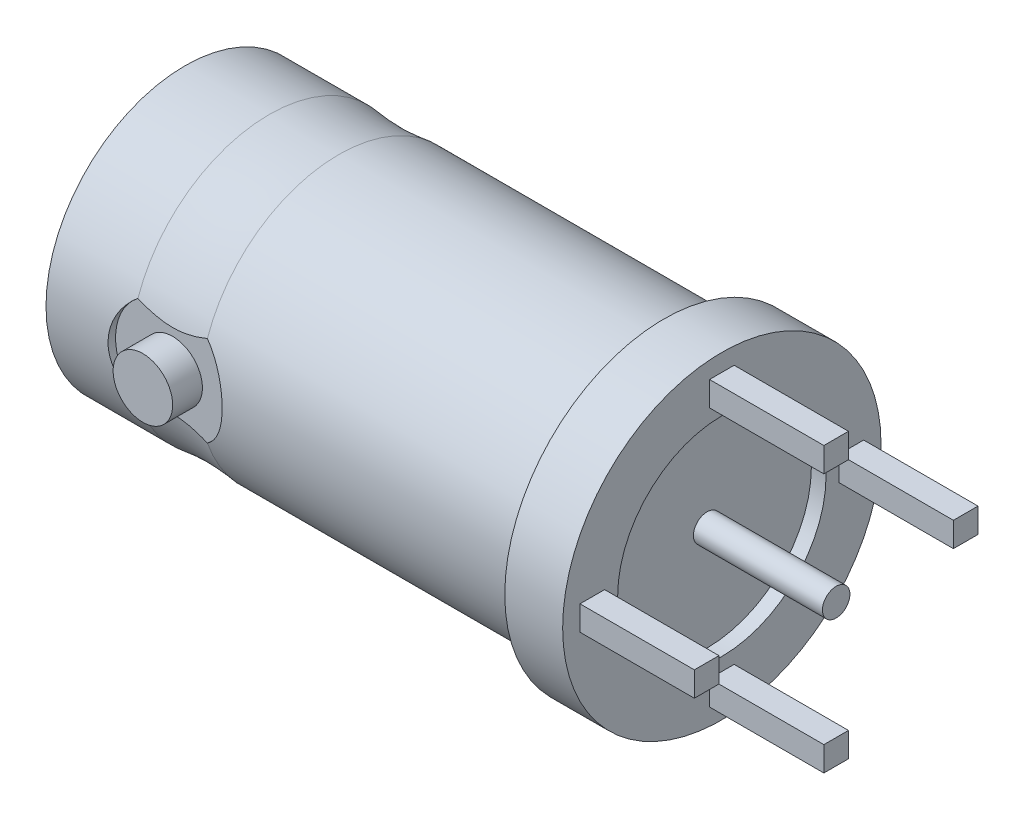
ISO-10303-21;
HEADER;
FILE_DESCRIPTION(('STEP AP214'),'2;1');
FILE_NAME('part.step','',(''),(''),'','','');
FILE_SCHEMA(('AUTOMOTIVE_DESIGN { 1 0 10303 214 1 1 1 1 }'));
ENDSEC;
DATA;
#1=APPLICATION_CONTEXT('core data for automotive mechanical design processes');
#2=APPLICATION_PROTOCOL_DEFINITION('international standard','automotive_design',2000,#1);
#3=PRODUCT_CONTEXT('',#1,'mechanical');
#4=PRODUCT('Part','Part','',(#3));
#5=PRODUCT_RELATED_PRODUCT_CATEGORY('part','',(#4));
#6=PRODUCT_DEFINITION_FORMATION('','',#4);
#7=PRODUCT_DEFINITION_CONTEXT('part definition',#1,'design');
#8=PRODUCT_DEFINITION('design','',#6,#7);
#9=PRODUCT_DEFINITION_SHAPE('','',#8);
#10=(LENGTH_UNIT() NAMED_UNIT(*) SI_UNIT(.MILLI.,.METRE.));
#11=(NAMED_UNIT(*) PLANE_ANGLE_UNIT() SI_UNIT($,.RADIAN.));
#12=(NAMED_UNIT(*) SI_UNIT($,.STERADIAN.) SOLID_ANGLE_UNIT());
#13=UNCERTAINTY_MEASURE_WITH_UNIT(LENGTH_MEASURE(1.E-05),#10,'distance_accuracy_value','');
#14=(GEOMETRIC_REPRESENTATION_CONTEXT(3) GLOBAL_UNCERTAINTY_ASSIGNED_CONTEXT((#13)) GLOBAL_UNIT_ASSIGNED_CONTEXT((#10,
#11,#12)) REPRESENTATION_CONTEXT('',''));
#15=CARTESIAN_POINT('',(0.,0.,0.));
#16=DIRECTION('',(0.,0.,1.));
#17=DIRECTION('',(1.,0.,0.));
#18=AXIS2_PLACEMENT_3D('',#15,#16,#17);
#19=CARTESIAN_POINT('',(-4.93285714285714,-1.27,-0.171428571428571));
#20=DIRECTION('',(1.,0.,0.));
#21=DIRECTION('',(0.,0.,1.));
#22=AXIS2_PLACEMENT_3D('',#19,#20,#21);
#23=PLANE('',#22);
#24=DIRECTION('',(0.,1.,0.));
#25=VECTOR('',#24,1.);
#26=CARTESIAN_POINT('',(-4.93285714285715,-1.27,0.171428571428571));
#27=LINE('',#26,#25);
#28=CARTESIAN_POINT('',(-4.93285714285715,-0.996961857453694,0.171428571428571));
#29=VERTEX_POINT('',#28);
#30=CARTESIAN_POINT('',(-4.93285714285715,-0.484873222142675,0.171428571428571));
#31=VERTEX_POINT('',#30);
#32=EDGE_CURVE('E28',#29,#31,#27,.T.);
#33=ORIENTED_EDGE('',*,*,#32,.T.);
#34=CARTESIAN_POINT('',(-4.93285714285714,0.,0.));
#35=DIRECTION('',(-1.,0.,0.));
#36=DIRECTION('',(0.,0.,-1.));
#37=AXIS2_PLACEMENT_3D('',#34,#35,#36);
#38=CIRCLE('',#37,0.514285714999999);
#39=CARTESIAN_POINT('',(-4.93285714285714,-0.484873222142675,-0.171428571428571));
#40=VERTEX_POINT('',#39);
#41=EDGE_CURVE('E1044',#40,#31,#38,.T.);
#42=ORIENTED_EDGE('',*,*,#41,.F.);
#43=DIRECTION('',(0.,1.,0.));
#44=VECTOR('',#43,1.);
#45=CARTESIAN_POINT('',(-4.93285714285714,-1.27,-0.171428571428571));
#46=LINE('',#45,#44);
#47=CARTESIAN_POINT('',(-4.93285714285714,-0.996961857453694,-0.171428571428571));
#48=VERTEX_POINT('',#47);
#49=EDGE_CURVE('E9',#48,#40,#46,.T.);
#50=ORIENTED_EDGE('',*,*,#49,.F.);
#51=CARTESIAN_POINT('',(-4.93285714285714,0.,0.));
#52=DIRECTION('',(1.,0.,0.));
#53=DIRECTION('',(0.,0.,-1.));
#54=AXIS2_PLACEMENT_3D('',#51,#52,#53);
#55=CIRCLE('',#54,1.01159314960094);
#56=EDGE_CURVE('E976',#29,#48,#55,.T.);
#57=ORIENTED_EDGE('',*,*,#56,.F.);
#58=EDGE_LOOP('',(#33,#42,#50,#57));
#59=FACE_BOUND('',#58,.T.);
#60=ADVANCED_FACE('F15',(#59),#23,.F.);
#61=CARTESIAN_POINT('',(-8.87851863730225,-1.27,0.));
#62=DIRECTION('',(-0.0434064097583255,0.,-0.999057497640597));
#63=DIRECTION('',(-0.999057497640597,0.,0.0434064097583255));
#64=AXIS2_PLACEMENT_3D('',#61,#62,#63);
#65=PLANE('',#64);
#66=ORIENTED_EDGE('',*,*,#49,.T.);
#67=CARTESIAN_POINT('',(-8.74285714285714,-0.514251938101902,-0.00589413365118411));
#68=CARTESIAN_POINT('',(-7.44142716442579,-0.513603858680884,-0.0624378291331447));
#69=CARTESIAN_POINT('',(-6.15993768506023,-0.503722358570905,-0.118115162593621));
#70=CARTESIAN_POINT('',(-4.93285714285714,-0.484873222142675,-0.171428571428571));
#71=(BOUNDED_CURVE() B_SPLINE_CURVE(3,(#67,#68,#69,#70),.UNSPECIFIED.,.F.,
.F.) B_SPLINE_CURVE_WITH_KNOTS((4,4),(1.58225739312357,1.91063323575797),
.UNSPECIFIED.) CURVE() GEOMETRIC_REPRESENTATION_ITEM() RATIONAL_B_SPLINE_CURVE((1.,
0.99103427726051,0.99103427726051,1.)) REPRESENTATION_ITEM(''));
#72=CARTESIAN_POINT('',(-8.74285714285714,-0.514251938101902,-0.00589413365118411));
#73=VERTEX_POINT('',#72);
#74=EDGE_CURVE('E1040',#73,#40,#71,.T.);
#75=ORIENTED_EDGE('',*,*,#74,.F.);
#76=DIRECTION('',(0.,1.,0.));
#77=VECTOR('',#76,1.);
#78=CARTESIAN_POINT('',(-8.74285714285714,0.,-0.00589413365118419));
#79=LINE('',#78,#77);
#80=CARTESIAN_POINT('',(-8.74285714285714,-0.761977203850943,-0.00589413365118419));
#81=VERTEX_POINT('',#80);
#82=EDGE_CURVE('E995',#81,#73,#79,.T.);
#83=ORIENTED_EDGE('',*,*,#82,.F.);
#84=CARTESIAN_POINT('',(-4.93285714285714,-0.996961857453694,-0.171428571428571));
#85=CARTESIAN_POINT('',(-5.56412192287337,-0.959716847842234,-0.14400178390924));
#86=CARTESIAN_POINT('',(-6.19535011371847,-0.921839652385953,-0.116576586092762));
#87=CARTESIAN_POINT('',(-6.82652203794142,-0.883050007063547,-0.0891538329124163));
#88=CARTESIAN_POINT('',(-7.46536859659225,-0.843788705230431,-0.0613976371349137));
#89=CARTESIAN_POINT('',(-8.10416012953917,-0.803604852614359,-0.0336438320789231));
#90=CARTESIAN_POINT('',(-8.74285714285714,-0.761977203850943,-0.00589413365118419));
#91=(BOUNDED_CURVE() B_SPLINE_CURVE(3,(#84,#85,#86,#87,#88,#89,#90),.UNSPECIFIED.,.F.,
.F.) B_SPLINE_CURVE_WITH_KNOTS((4,3,4),(2.00536022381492E-07,0.00189907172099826,
0.00382103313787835),
.UNSPECIFIED.) CURVE() GEOMETRIC_REPRESENTATION_ITEM() RATIONAL_B_SPLINE_CURVE((1.,1.,1.,1.,1.,
1.,1.)) REPRESENTATION_ITEM(''));
#92=EDGE_CURVE('E972',#48,#81,#91,.T.);
#93=ORIENTED_EDGE('',*,*,#92,.F.);
#94=EDGE_LOOP('',(#66,#75,#83,#93));
#95=FACE_BOUND('',#94,.T.);
#96=ADVANCED_FACE('F1251',(#95),#65,.F.);
#97=CARTESIAN_POINT('',(-8.87851863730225,-1.27,0.));
#98=DIRECTION('',(-0.0434064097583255,0.,0.999057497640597));
#99=DIRECTION('',(0.,1.,0.));
#100=AXIS2_PLACEMENT_3D('',#97,#98,#99);
#101=PLANE('',#100);
#102=DIRECTION('',(0.,-1.,0.));
#103=VECTOR('',#102,1.);
#104=CARTESIAN_POINT('',(-8.74285714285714,0.,0.00589413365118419));
#105=LINE('',#104,#103);
#106=CARTESIAN_POINT('',(-8.74285714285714,-0.514251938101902,0.00589413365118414));
#107=VERTEX_POINT('',#106);
#108=CARTESIAN_POINT('',(-8.74285714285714,-0.761977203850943,0.00589413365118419));
#109=VERTEX_POINT('',#108);
#110=EDGE_CURVE('E999',#107,#109,#105,.T.);
#111=ORIENTED_EDGE('',*,*,#110,.F.);
#112=CARTESIAN_POINT('',(-4.93285714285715,-0.484873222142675,0.171428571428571));
#113=CARTESIAN_POINT('',(-6.15993768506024,-0.503722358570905,0.118115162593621));
#114=CARTESIAN_POINT('',(-7.44142716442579,-0.513603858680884,0.0624378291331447));
#115=CARTESIAN_POINT('',(-8.74285714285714,-0.514251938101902,0.00589413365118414));
#116=(BOUNDED_CURVE() B_SPLINE_CURVE(3,(#112,#113,#114,#115),.UNSPECIFIED.,.F.,
.F.) B_SPLINE_CURVE_WITH_KNOTS((4,4),(4.37255207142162,4.70092791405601),
.UNSPECIFIED.) CURVE() GEOMETRIC_REPRESENTATION_ITEM() RATIONAL_B_SPLINE_CURVE((1.,
0.99103427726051,0.99103427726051,1.)) REPRESENTATION_ITEM(''));
#117=EDGE_CURVE('E938',#31,#107,#116,.T.);
#118=ORIENTED_EDGE('',*,*,#117,.F.);
#119=ORIENTED_EDGE('',*,*,#32,.F.);
#120=CARTESIAN_POINT('',(-8.74285714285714,-0.761977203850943,0.00589413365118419));
#121=CARTESIAN_POINT('',(-8.26755784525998,-0.792955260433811,0.0265446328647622));
#122=CARTESIAN_POINT('',(-7.79220576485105,-0.823126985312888,0.0471974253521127));
#123=CARTESIAN_POINT('',(-7.31681867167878,-0.852724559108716,0.0678517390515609));
#124=CARTESIAN_POINT('',(-6.52225003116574,-0.90219435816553,0.102373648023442));
#125=CARTESIAN_POINT('',(-5.72758194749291,-0.950072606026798,0.136899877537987));
#126=CARTESIAN_POINT('',(-4.93285714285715,-0.996961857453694,0.171428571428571));
#127=(BOUNDED_CURVE() B_SPLINE_CURVE(3,(#120,#121,#122,#123,#124,#125,#126),.UNSPECIFIED.,.F.,
.F.) B_SPLINE_CURVE_WITH_KNOTS((4,3,4),(2.00612386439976E-07,0.00143046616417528,
0.00382103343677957),
.UNSPECIFIED.) CURVE() GEOMETRIC_REPRESENTATION_ITEM() RATIONAL_B_SPLINE_CURVE((1.,1.,1.,1.,1.,
1.,1.)) REPRESENTATION_ITEM(''));
#128=EDGE_CURVE('E1149',#109,#29,#127,.T.);
#129=ORIENTED_EDGE('',*,*,#128,.F.);
#130=EDGE_LOOP('',(#111,#118,#119,#129));
#131=FACE_BOUND('',#130,.T.);
#132=ADVANCED_FACE('F1256',(#131),#101,.F.);
#133=CARTESIAN_POINT('',(-8.87851863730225,-1.27,0.));
#134=DIRECTION('',(-0.0434064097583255,0.,0.999057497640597));
#135=DIRECTION('',(0.,1.,0.));
#136=AXIS2_PLACEMENT_3D('',#133,#134,#135);
#137=PLANE('',#136);
#138=DIRECTION('',(0.,1.,0.));
#139=VECTOR('',#138,1.);
#140=CARTESIAN_POINT('',(-4.93285714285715,-1.27,0.171428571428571));
#141=LINE('',#140,#139);
#142=CARTESIAN_POINT('',(-4.93285714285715,0.484873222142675,0.171428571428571));
#143=VERTEX_POINT('',#142);
#144=CARTESIAN_POINT('',(-4.93285714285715,0.996961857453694,0.171428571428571));
#145=VERTEX_POINT('',#144);
#146=EDGE_CURVE('E809',#143,#145,#141,.T.);
#147=ORIENTED_EDGE('',*,*,#146,.F.);
#148=CARTESIAN_POINT('',(-8.74285714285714,0.514251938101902,0.00589413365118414));
#149=CARTESIAN_POINT('',(-7.44142716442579,0.513603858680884,0.0624378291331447));
#150=CARTESIAN_POINT('',(-6.15993768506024,0.503722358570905,0.118115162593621));
#151=CARTESIAN_POINT('',(-4.93285714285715,0.484873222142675,0.171428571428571));
#152=(BOUNDED_CURVE() B_SPLINE_CURVE(3,(#148,#149,#150,#151),.UNSPECIFIED.,.F.,
.F.) B_SPLINE_CURVE_WITH_KNOTS((4,4),(1.58225739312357,1.91063323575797),
.UNSPECIFIED.) CURVE() GEOMETRIC_REPRESENTATION_ITEM() RATIONAL_B_SPLINE_CURVE((1.,
0.99103427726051,0.99103427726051,1.)) REPRESENTATION_ITEM(''));
#153=CARTESIAN_POINT('',(-8.74285714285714,0.514251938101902,0.00589413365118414));
#154=VERTEX_POINT('',#153);
#155=EDGE_CURVE('E1021',#154,#143,#152,.T.);
#156=ORIENTED_EDGE('',*,*,#155,.F.);
#157=DIRECTION('',(0.,-1.,0.));
#158=VECTOR('',#157,1.);
#159=CARTESIAN_POINT('',(-8.74285714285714,0.,0.00589413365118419));
#160=LINE('',#159,#158);
#161=CARTESIAN_POINT('',(-8.74285714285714,0.761977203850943,0.00589413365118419));
#162=VERTEX_POINT('',#161);
#163=EDGE_CURVE('E1002',#162,#154,#160,.T.);
#164=ORIENTED_EDGE('',*,*,#163,.F.);
#165=CARTESIAN_POINT('',(-4.93285714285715,0.996961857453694,0.171428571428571));
#166=CARTESIAN_POINT('',(-5.56412192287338,0.959716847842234,0.14400178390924));
#167=CARTESIAN_POINT('',(-6.19535011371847,0.921839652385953,0.116576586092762));
#168=CARTESIAN_POINT('',(-6.82652203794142,0.883050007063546,0.0891538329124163));
#169=CARTESIAN_POINT('',(-7.46536859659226,0.843788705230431,0.0613976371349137));
#170=CARTESIAN_POINT('',(-8.10416012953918,0.803604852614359,0.0336438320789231));
#171=CARTESIAN_POINT('',(-8.74285714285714,0.761977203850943,0.00589413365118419));
#172=(BOUNDED_CURVE() B_SPLINE_CURVE(3,(#165,#166,#167,#168,#169,#170,#171),.UNSPECIFIED.,.F.,
.F.) B_SPLINE_CURVE_WITH_KNOTS((4,3,4),(2.00536022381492E-07,0.00189907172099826,
0.00382103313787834),
.UNSPECIFIED.) CURVE() GEOMETRIC_REPRESENTATION_ITEM() RATIONAL_B_SPLINE_CURVE((1.,1.,1.,1.,1.,
1.,1.)) REPRESENTATION_ITEM(''));
#173=EDGE_CURVE('E797',#145,#162,#172,.T.);
#174=ORIENTED_EDGE('',*,*,#173,.F.);
#175=EDGE_LOOP('',(#147,#156,#164,#174));
#176=FACE_BOUND('',#175,.T.);
#177=ADVANCED_FACE('F727',(#176),#137,.F.);
#178=CARTESIAN_POINT('',(-8.87851863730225,-1.27,0.));
#179=DIRECTION('',(-0.0434064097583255,0.,-0.999057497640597));
#180=DIRECTION('',(-0.999057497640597,0.,0.0434064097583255));
#181=AXIS2_PLACEMENT_3D('',#178,#179,#180);
#182=PLANE('',#181);
#183=DIRECTION('',(0.,1.,0.));
#184=VECTOR('',#183,1.);
#185=CARTESIAN_POINT('',(-8.74285714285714,0.,-0.00589413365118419));
#186=LINE('',#185,#184);
#187=CARTESIAN_POINT('',(-8.74285714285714,0.514251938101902,-0.00589413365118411));
#188=VERTEX_POINT('',#187);
#189=CARTESIAN_POINT('',(-8.74285714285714,0.761977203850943,-0.00589413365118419));
#190=VERTEX_POINT('',#189);
#191=EDGE_CURVE('E810',#188,#190,#186,.T.);
#192=ORIENTED_EDGE('',*,*,#191,.F.);
#193=CARTESIAN_POINT('',(-4.93285714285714,0.484873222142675,-0.171428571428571));
#194=CARTESIAN_POINT('',(-6.15993768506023,0.503722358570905,-0.118115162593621));
#195=CARTESIAN_POINT('',(-7.44142716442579,0.513603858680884,-0.0624378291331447));
#196=CARTESIAN_POINT('',(-8.74285714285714,0.514251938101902,-0.00589413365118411));
#197=(BOUNDED_CURVE() B_SPLINE_CURVE(3,(#193,#194,#195,#196),.UNSPECIFIED.,.F.,
.F.) B_SPLINE_CURVE_WITH_KNOTS((4,4),(4.37255207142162,4.70092791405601),
.UNSPECIFIED.) CURVE() GEOMETRIC_REPRESENTATION_ITEM() RATIONAL_B_SPLINE_CURVE((1.,
0.99103427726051,0.99103427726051,1.)) REPRESENTATION_ITEM(''));
#198=CARTESIAN_POINT('',(-4.93285714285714,0.484873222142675,-0.171428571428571));
#199=VERTEX_POINT('',#198);
#200=EDGE_CURVE('E775',#199,#188,#197,.T.);
#201=ORIENTED_EDGE('',*,*,#200,.F.);
#202=DIRECTION('',(0.,1.,0.));
#203=VECTOR('',#202,1.);
#204=CARTESIAN_POINT('',(-4.93285714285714,-1.27,-0.171428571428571));
#205=LINE('',#204,#203);
#206=CARTESIAN_POINT('',(-4.93285714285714,0.996961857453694,-0.171428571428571));
#207=VERTEX_POINT('',#206);
#208=EDGE_CURVE('E806',#199,#207,#205,.T.);
#209=ORIENTED_EDGE('',*,*,#208,.T.);
#210=CARTESIAN_POINT('',(-8.74285714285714,0.761977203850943,-0.00589413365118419));
#211=CARTESIAN_POINT('',(-8.26755784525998,0.792955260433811,-0.0265446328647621));
#212=CARTESIAN_POINT('',(-7.79220576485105,0.823126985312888,-0.0471974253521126));
#213=CARTESIAN_POINT('',(-7.31681867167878,0.852724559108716,-0.0678517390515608));
#214=CARTESIAN_POINT('',(-6.52225003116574,0.90219435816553,-0.102373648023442));
#215=CARTESIAN_POINT('',(-5.72758194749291,0.950072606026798,-0.136899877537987));
#216=CARTESIAN_POINT('',(-4.93285714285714,0.996961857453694,-0.171428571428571));
#217=(BOUNDED_CURVE() B_SPLINE_CURVE(3,(#210,#211,#212,#213,#214,#215,#216),.UNSPECIFIED.,.F.,
.F.) B_SPLINE_CURVE_WITH_KNOTS((4,3,4),(2.00612386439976E-07,0.00143046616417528,
0.00382103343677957),
.UNSPECIFIED.) CURVE() GEOMETRIC_REPRESENTATION_ITEM() RATIONAL_B_SPLINE_CURVE((1.,1.,1.,1.,1.,
1.,1.)) REPRESENTATION_ITEM(''));
#218=EDGE_CURVE('E937',#190,#207,#217,.T.);
#219=ORIENTED_EDGE('',*,*,#218,.F.);
#220=EDGE_LOOP('',(#192,#201,#209,#219));
#221=FACE_BOUND('',#220,.T.);
#222=ADVANCED_FACE('F1439',(#221),#182,.F.);
#223=CARTESIAN_POINT('',(-4.93285714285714,-1.27,-0.171428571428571));
#224=DIRECTION('',(1.,0.,0.));
#225=DIRECTION('',(0.,0.,1.));
#226=AXIS2_PLACEMENT_3D('',#223,#224,#225);
#227=PLANE('',#226);
#228=ORIENTED_EDGE('',*,*,#208,.F.);
#229=CARTESIAN_POINT('',(-4.93285714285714,0.,0.));
#230=DIRECTION('',(-1.,0.,0.));
#231=DIRECTION('',(0.,0.,-1.));
#232=AXIS2_PLACEMENT_3D('',#229,#230,#231);
#233=CIRCLE('',#232,0.514285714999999);
#234=EDGE_CURVE('E780',#143,#199,#233,.T.);
#235=ORIENTED_EDGE('',*,*,#234,.F.);
#236=ORIENTED_EDGE('',*,*,#146,.T.);
#237=CARTESIAN_POINT('',(-4.93285714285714,0.,0.));
#238=DIRECTION('',(1.,0.,0.));
#239=DIRECTION('',(0.,0.,-1.));
#240=AXIS2_PLACEMENT_3D('',#237,#238,#239);
#241=CIRCLE('',#240,1.01159314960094);
#242=EDGE_CURVE('E802',#207,#145,#241,.T.);
#243=ORIENTED_EDGE('',*,*,#242,.F.);
#244=EDGE_LOOP('',(#228,#235,#236,#243));
#245=FACE_BOUND('',#244,.T.);
#246=ADVANCED_FACE('F1245',(#245),#227,.F.);
#247=CARTESIAN_POINT('',(-8.74285714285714,0.,-0.762));
#248=DIRECTION('',(1.,0.,0.));
#249=DIRECTION('',(0.,1.,0.));
#250=AXIS2_PLACEMENT_3D('',#247,#248,#249);
#251=PLANE('',#250);
#252=CARTESIAN_POINT('',(-8.74285714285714,0.,0.));
#253=DIRECTION('',(-1.,0.,0.));
#254=DIRECTION('',(0.,0.,1.));
#255=AXIS2_PLACEMENT_3D('',#252,#253,#254);
#256=CIRCLE('',#255,0.762);
#257=EDGE_CURVE('E933',#190,#81,#256,.T.);
#258=ORIENTED_EDGE('',*,*,#257,.T.);
#259=ORIENTED_EDGE('',*,*,#82,.T.);
#260=CARTESIAN_POINT('',(-8.74285714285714,0.,0.));
#261=DIRECTION('',(-1.,0.,0.));
#262=DIRECTION('',(0.,0.,1.));
#263=AXIS2_PLACEMENT_3D('',#260,#261,#262);
#264=CIRCLE('',#263,0.514285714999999);
#265=EDGE_CURVE('E779',#188,#73,#264,.T.);
#266=ORIENTED_EDGE('',*,*,#265,.F.);
#267=ORIENTED_EDGE('',*,*,#191,.T.);
#268=EDGE_LOOP('',(#258,#259,#266,#267));
#269=FACE_BOUND('',#268,.T.);
#270=ADVANCED_FACE('F1240',(#269),#251,.F.);
#271=CARTESIAN_POINT('',(-7.88571428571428,0.,5.56695148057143));
#272=DIRECTION('',(0.,0.,1.));
#273=DIRECTION('',(1.,0.,0.));
#274=AXIS2_PLACEMENT_3D('',#271,#272,#273);
#275=PLANE('',#274);
#276=CARTESIAN_POINT('',(-7.88571428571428,0.,5.56695148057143));
#277=DIRECTION('',(0.,0.,-1.));
#278=DIRECTION('',(-1.,0.,0.));
#279=AXIS2_PLACEMENT_3D('',#276,#277,#278);
#280=CIRCLE('',#279,1.02857142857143);
#281=CARTESIAN_POINT('',(-6.85714285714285,0.,5.56695148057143));
#282=VERTEX_POINT('',#281);
#283=EDGE_CURVE('E832',#282,#282,#280,.T.);
#284=ORIENTED_EDGE('',*,*,#283,.F.);
#285=EDGE_LOOP('',(#284));
#286=FACE_BOUND('',#285,.T.);
#287=ADVANCED_FACE('F1244',(#286),#275,.T.);
#288=CARTESIAN_POINT('',(-7.88571428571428,0.,-5.56695148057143));
#289=DIRECTION('',(0.,0.,-1.));
#290=DIRECTION('',(0.,-1.,0.));
#291=AXIS2_PLACEMENT_3D('',#288,#289,#290);
#292=PLANE('',#291);
#293=CARTESIAN_POINT('',(-7.88571428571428,0.,-5.56695148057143));
#294=DIRECTION('',(0.,0.,-1.));
#295=DIRECTION('',(-1.,0.,0.));
#296=AXIS2_PLACEMENT_3D('',#293,#294,#295);
#297=CIRCLE('',#296,1.02857142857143);
#298=CARTESIAN_POINT('',(-6.85714285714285,0.,-5.56695148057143));
#299=VERTEX_POINT('',#298);
#300=EDGE_CURVE('E70',#299,#299,#297,.T.);
#301=ORIENTED_EDGE('',*,*,#300,.T.);
#302=EDGE_LOOP('',(#301));
#303=FACE_BOUND('',#302,.T.);
#304=ADVANCED_FACE('F511',(#303),#292,.T.);
#305=CARTESIAN_POINT('',(-7.88571428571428,0.,4.538380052));
#306=DIRECTION('',(0.,0.,-1.));
#307=DIRECTION('',(0.,-1.,0.));
#308=AXIS2_PLACEMENT_3D('',#305,#306,#307);
#309=PLANE('',#308);
#310=CARTESIAN_POINT('',(-7.88571428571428,0.,4.538380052));
#311=DIRECTION('',(0.,0.,-1.));
#312=DIRECTION('',(-1.,0.,0.));
#313=AXIS2_PLACEMENT_3D('',#310,#311,#312);
#314=CIRCLE('',#313,1.02857142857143);
#315=CARTESIAN_POINT('',(-8.91428571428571,0.,4.538380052));
#316=VERTEX_POINT('',#315);
#317=EDGE_CURVE('E85',#316,#316,#314,.T.);
#318=ORIENTED_EDGE('',*,*,#317,.T.);
#319=EDGE_LOOP('',(#318));
#320=FACE_BOUND('',#319,.T.);
#321=CARTESIAN_POINT('',(-7.88571428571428,0.,4.538380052));
#322=DIRECTION('',(0.,0.,1.));
#323=DIRECTION('',(1.,0.,0.));
#324=AXIS2_PLACEMENT_3D('',#321,#322,#323);
#325=CIRCLE('',#324,1.97142857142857);
#326=CARTESIAN_POINT('',(-6.68428842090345,-1.5630439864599,4.538380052));
#327=VERTEX_POINT('',#326);
#328=CARTESIAN_POINT('',(-6.68428842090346,1.5630439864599,4.538380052));
#329=VERTEX_POINT('',#328);
#330=EDGE_CURVE('E860',#327,#329,#325,.T.);
#331=ORIENTED_EDGE('',*,*,#330,.T.);
#332=DIRECTION('',(1.,0.,0.));
#333=VECTOR('',#332,1.);
#334=CARTESIAN_POINT('',(-129.927220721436,1.5630439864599,4.538380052));
#335=LINE('',#334,#333);
#336=CARTESIAN_POINT('',(-6.68571428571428,1.5630439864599,4.538380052));
#337=VERTEX_POINT('',#336);
#338=EDGE_CURVE('E452',#337,#329,#335,.T.);
#339=ORIENTED_EDGE('',*,*,#338,.F.);
#340=CARTESIAN_POINT('',(-6.68571428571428,1.5630439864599,4.538380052));
#341=CARTESIAN_POINT('',(-6.99549811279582,1.43344509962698,4.538380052));
#342=CARTESIAN_POINT('',(-7.27349448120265,1.36684841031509,4.538380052));
#343=CARTESIAN_POINT('',(-7.58692942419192,1.29176207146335,4.538380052));
#344=CARTESIAN_POINT('',(-7.88571428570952,1.29176207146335,4.538380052));
#345=B_SPLINE_CURVE_WITH_KNOTS('',2,(#340,#341,#342,#343,#344),.UNSPECIFIED.,.F.,.F.,(3,2,3),
(0.,0.5,1.),.UNSPECIFIED.);
#346=CARTESIAN_POINT('',(-7.88571428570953,1.29176207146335,4.538380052));
#347=VERTEX_POINT('',#346);
#348=EDGE_CURVE('E540',#337,#347,#345,.T.);
#349=ORIENTED_EDGE('',*,*,#348,.T.);
#350=CARTESIAN_POINT('',(-7.88571428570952,1.29176207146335,4.538380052));
#351=CARTESIAN_POINT('',(-8.18540700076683,1.29176207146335,4.538380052));
#352=CARTESIAN_POINT('',(-8.5009409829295,1.36756977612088,4.538380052));
#353=CARTESIAN_POINT('',(-8.7770055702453,1.43389487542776,4.538380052));
#354=CARTESIAN_POINT('',(-9.08571428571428,1.56304398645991,4.538380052));
#355=B_SPLINE_CURVE_WITH_KNOTS('',2,(#350,#351,#352,#353,#354),.UNSPECIFIED.,.F.,.F.,(3,2,3),
(0.,0.5,1.),.UNSPECIFIED.);
#356=CARTESIAN_POINT('',(-9.08571428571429,1.56304398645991,4.538380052));
#357=VERTEX_POINT('',#356);
#358=EDGE_CURVE('E551',#347,#357,#355,.T.);
#359=ORIENTED_EDGE('',*,*,#358,.T.);
#360=DIRECTION('',(1.,0.,0.));
#361=VECTOR('',#360,1.);
#362=CARTESIAN_POINT('',(-129.927220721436,1.5630439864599,4.538380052));
#363=LINE('',#362,#361);
#364=CARTESIAN_POINT('',(-9.0871401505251,1.5630439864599,4.538380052));
#365=VERTEX_POINT('',#364);
#366=EDGE_CURVE('E683',#365,#357,#363,.T.);
#367=ORIENTED_EDGE('',*,*,#366,.F.);
#368=CARTESIAN_POINT('',(-7.88571428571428,0.,4.538380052));
#369=DIRECTION('',(0.,0.,1.));
#370=DIRECTION('',(1.,0.,0.));
#371=AXIS2_PLACEMENT_3D('',#368,#369,#370);
#372=CIRCLE('',#371,1.97142857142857);
#373=CARTESIAN_POINT('',(-9.08714015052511,-1.5630439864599,4.538380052));
#374=VERTEX_POINT('',#373);
#375=EDGE_CURVE('E849',#365,#374,#372,.T.);
#376=ORIENTED_EDGE('',*,*,#375,.T.);
#377=DIRECTION('',(-1.,0.,0.));
#378=VECTOR('',#377,1.);
#379=CARTESIAN_POINT('',(-129.927220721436,-1.5630439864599,4.538380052));
#380=LINE('',#379,#378);
#381=CARTESIAN_POINT('',(-9.08571428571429,-1.5630439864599,4.538380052));
#382=VERTEX_POINT('',#381);
#383=EDGE_CURVE('E690',#382,#374,#380,.T.);
#384=ORIENTED_EDGE('',*,*,#383,.F.);
#385=CARTESIAN_POINT('',(-9.08571428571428,-1.5630439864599,4.538380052));
#386=CARTESIAN_POINT('',(-8.77625481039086,-1.43358079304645,4.538380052));
#387=CARTESIAN_POINT('',(-8.49852801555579,-1.36699064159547,4.538380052));
#388=CARTESIAN_POINT('',(-8.18477306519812,-1.29176207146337,4.538380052));
#389=CARTESIAN_POINT('',(-7.88571428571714,-1.29176207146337,4.538380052));
#390=B_SPLINE_CURVE_WITH_KNOTS('',2,(#385,#386,#387,#388,#389),.UNSPECIFIED.,.F.,.F.,(3,2,3),
(0.,0.5,1.),.UNSPECIFIED.);
#391=CARTESIAN_POINT('',(-7.88571428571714,-1.29176207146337,4.538380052));
#392=VERTEX_POINT('',#391);
#393=EDGE_CURVE('E493',#382,#392,#390,.T.);
#394=ORIENTED_EDGE('',*,*,#393,.T.);
#395=CARTESIAN_POINT('',(-7.88571428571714,-1.29176207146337,4.538380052));
#396=CARTESIAN_POINT('',(-7.58622171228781,-1.29176207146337,4.538380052));
#397=CARTESIAN_POINT('',(-7.27088592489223,-1.3674740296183,4.538380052));
#398=CARTESIAN_POINT('',(-6.99465997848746,-1.43379573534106,4.538380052));
#399=CARTESIAN_POINT('',(-6.68571428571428,-1.5630439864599,4.538380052));
#400=B_SPLINE_CURVE_WITH_KNOTS('',2,(#395,#396,#397,#398,#399),.UNSPECIFIED.,.F.,.F.,(3,2,3),
(0.,0.5,1.),.UNSPECIFIED.);
#401=CARTESIAN_POINT('',(-6.68571428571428,-1.5630439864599,4.538380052));
#402=VERTEX_POINT('',#401);
#403=EDGE_CURVE('E784',#392,#402,#400,.T.);
#404=ORIENTED_EDGE('',*,*,#403,.T.);
#405=DIRECTION('',(-1.,0.,0.));
#406=VECTOR('',#405,1.);
#407=CARTESIAN_POINT('',(-129.927220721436,-1.5630439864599,4.538380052));
#408=LINE('',#407,#406);
#409=EDGE_CURVE('E476',#327,#402,#408,.T.);
#410=ORIENTED_EDGE('',*,*,#409,.F.);
#411=EDGE_LOOP('',(#331,#339,#349,#359,#367,#376,#384,#394,#404,#410));
#412=FACE_BOUND('',#411,.T.);
#413=ADVANCED_FACE('F500',(#320,#412),#309,.F.);
#414=CARTESIAN_POINT('',(-7.88571428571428,0.,4.538380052));
#415=DIRECTION('',(0.,0.,1.));
#416=DIRECTION('',(1.,0.,0.));
#417=AXIS2_PLACEMENT_3D('',#414,#415,#416);
#418=CYLINDRICAL_SURFACE('',#417,1.97142857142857);
#419=ORIENTED_EDGE('',*,*,#375,.F.);
#420=CARTESIAN_POINT('',(-9.85714285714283,0.,4.8));
#421=CARTESIAN_POINT('',(-9.85714318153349,0.0190397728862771,4.80000014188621));
#422=CARTESIAN_POINT('',(-9.85686988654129,0.0380796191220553,4.79988671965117));
#423=CARTESIAN_POINT('',(-9.8557750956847,0.0761072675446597,4.79943416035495));
#424=CARTESIAN_POINT('',(-9.8549545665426,0.0950951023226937,4.79909542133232));
#425=CARTESIAN_POINT('',(-9.85276537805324,0.133016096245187,4.79819405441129));
#426=CARTESIAN_POINT('',(-9.85139722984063,0.151949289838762,4.7976316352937));
#427=CARTESIAN_POINT('',(-9.84811336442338,0.189758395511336,4.79628497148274));
#428=CARTESIAN_POINT('',(-9.84619769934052,0.208634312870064,4.79550074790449));
#429=CARTESIAN_POINT('',(-9.84181923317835,0.246326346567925,4.79371250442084));
#430=CARTESIAN_POINT('',(-9.83935602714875,0.265142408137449,4.79270832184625));
#431=CARTESIAN_POINT('',(-9.83388294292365,0.302712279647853,4.79048222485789));
#432=CARTESIAN_POINT('',(-9.83087220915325,0.321465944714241,4.78925996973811));
#433=CARTESIAN_POINT('',(-9.82430451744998,0.35890864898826,4.78659980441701));
#434=CARTESIAN_POINT('',(-9.82074626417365,0.377597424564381,4.78516138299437));
#435=CARTESIAN_POINT('',(-9.81308396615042,0.414908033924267,4.78207098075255));
#436=CARTESIAN_POINT('',(-9.80897820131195,0.433529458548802,4.78041832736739));
#437=CARTESIAN_POINT('',(-9.8002769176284,0.470467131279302,4.7769238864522));
#438=CARTESIAN_POINT('',(-9.79568597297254,0.488784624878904,4.77508387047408));
#439=CARTESIAN_POINT('',(-9.78599116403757,0.52524671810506,4.77121072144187));
#440=CARTESIAN_POINT('',(-9.78088771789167,0.543391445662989,4.76917774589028));
#441=CARTESIAN_POINT('',(-9.77016822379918,0.579506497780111,4.76492421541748));
#442=CARTESIAN_POINT('',(-9.76455218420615,0.597476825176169,4.76270366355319));
#443=CARTESIAN_POINT('',(-9.75280826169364,0.633240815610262,4.75808065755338));
#444=CARTESIAN_POINT('',(-9.74667998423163,0.651034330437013,4.75567806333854));
#445=CARTESIAN_POINT('',(-9.72750743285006,0.704203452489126,4.74819759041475));
#446=CARTESIAN_POINT('',(-9.71370374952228,0.739272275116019,4.74285831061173));
#447=CARTESIAN_POINT('',(-9.68405531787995,0.808687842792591,4.73151868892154));
#448=CARTESIAN_POINT('',(-9.66819833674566,0.843028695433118,4.72551441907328));
#449=CARTESIAN_POINT('',(-9.63472295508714,0.910448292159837,4.71298750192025));
#450=CARTESIAN_POINT('',(-9.6171171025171,0.943533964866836,4.70646860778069));
#451=CARTESIAN_POINT('',(-9.58013069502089,1.0085164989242,4.69297281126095));
#452=CARTESIAN_POINT('',(-9.56075353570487,1.04041547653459,4.68599679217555));
#453=CARTESIAN_POINT('',(-9.52022833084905,1.10302739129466,4.67165529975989));
#454=CARTESIAN_POINT('',(-9.49907839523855,1.13373901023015,4.66428941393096));
#455=CARTESIAN_POINT('',(-9.45501364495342,1.19398274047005,4.64923362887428));
#456=CARTESIAN_POINT('',(-9.4320920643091,1.22350960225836,4.64154254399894));
#457=CARTESIAN_POINT('',(-9.38458523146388,1.2812738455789,4.62593067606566));
#458=CARTESIAN_POINT('',(-9.35999550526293,1.30950738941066,4.61800931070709));
#459=CARTESIAN_POINT('',(-9.3093488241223,1.36440554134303,4.60208774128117));
#460=CARTESIAN_POINT('',(-9.28329751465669,1.39107546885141,4.59408792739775));
#461=CARTESIAN_POINT('',(-9.22973201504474,1.4428630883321,4.57808696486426));
#462=CARTESIAN_POINT('',(-9.20221883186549,1.46798182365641,4.57008582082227));
#463=CARTESIAN_POINT('',(-9.14573727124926,1.51669121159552,4.55415260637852));
#464=CARTESIAN_POINT('',(-9.11676570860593,1.54027823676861,4.54622073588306));
#465=CARTESIAN_POINT('',(-9.08714015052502,1.5630439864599,4.538380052));
#466=B_SPLINE_CURVE_WITH_KNOTS('',3,(#420,#421,#422,#423,#424,#425,#426,#427,#428,#429,#430,
#431,#432,#433,#434,#435,#436,#437,#438,#439,#440,#441,#442,#443,#444,#445,#446,#447,#448,#449,
#450,#451,#452,#453,#454,#455,#456,#457,#458,#459,#460,#461,#462,#463,#464,#465),.UNSPECIFIED.,
.F.,.F.,(4,2,2,2,2,2,2,2,2,2,2,2,2,2,2,2,2,2,2,2,2,2,4),(0.,0.0571171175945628,
0.114133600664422,0.171096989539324,0.228054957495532,0.285055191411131,0.342145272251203,
0.399372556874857,0.456784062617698,0.513695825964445,0.57056152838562,0.627426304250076,
0.68433529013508,0.798453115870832,0.913285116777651,1.02734572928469,1.14119209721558,
1.25516142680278,1.36958983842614,1.48433830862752,1.5986705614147,1.71292505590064,
1.82744094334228),.UNSPECIFIED.);
#467=CARTESIAN_POINT('',(-9.85714285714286,0.,4.8));
#468=VERTEX_POINT('',#467);
#469=EDGE_CURVE('E693',#468,#365,#466,.T.);
#470=ORIENTED_EDGE('',*,*,#469,.F.);
#471=CARTESIAN_POINT('',(-9.08714015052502,-1.56304398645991,4.538380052));
#472=CARTESIAN_POINT('',(-9.10710983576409,-1.5476953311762,4.54366612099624));
#473=CARTESIAN_POINT('',(-9.12679594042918,-1.53198893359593,4.54898848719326));
#474=CARTESIAN_POINT('',(-9.16543678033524,-1.49997014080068,4.55964610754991));
#475=CARTESIAN_POINT('',(-9.1843954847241,-1.48366242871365,4.56498104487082));
#476=CARTESIAN_POINT('',(-9.22158178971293,-1.45043716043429,4.57564582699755));
#477=CARTESIAN_POINT('',(-9.23981276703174,-1.43352334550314,4.58097554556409));
#478=CARTESIAN_POINT('',(-9.27554430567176,-1.39908342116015,4.59161072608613));
#479=CARTESIAN_POINT('',(-9.29304754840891,-1.38156009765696,4.59691619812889));
#480=CARTESIAN_POINT('',(-9.32732431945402,-1.34589863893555,4.60748323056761));
#481=CARTESIAN_POINT('',(-9.344099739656,-1.32776234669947,4.61274487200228));
#482=CARTESIAN_POINT('',(-9.37692168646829,-1.29087278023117,4.62320391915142));
#483=CARTESIAN_POINT('',(-9.39296923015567,-1.27212043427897,4.62840140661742));
#484=CARTESIAN_POINT('',(-9.42433630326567,-1.23399684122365,4.63871120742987));
#485=CARTESIAN_POINT('',(-9.43965590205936,-1.21462565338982,4.64382352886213));
#486=CARTESIAN_POINT('',(-9.46956809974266,-1.17526279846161,4.65394142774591));
#487=CARTESIAN_POINT('',(-9.4841597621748,-1.15527038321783,4.65894686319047));
#488=CARTESIAN_POINT('',(-9.51261691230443,-1.11466370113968,4.66882882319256));
#489=CARTESIAN_POINT('',(-9.52648041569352,-1.09404795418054,4.67370497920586));
#490=CARTESIAN_POINT('',(-9.55348301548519,-1.0521940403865,4.68330551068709));
#491=CARTESIAN_POINT('',(-9.56661905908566,-1.03095375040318,4.68802921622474));
#492=CARTESIAN_POINT('',(-9.59216512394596,-0.987848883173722,4.69730167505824));
#493=CARTESIAN_POINT('',(-9.60457100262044,-0.965981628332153,4.70184938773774));
#494=CARTESIAN_POINT('',(-9.62866790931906,-0.921627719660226,4.71074488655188));
#495=CARTESIAN_POINT('',(-9.64035379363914,-0.899137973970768,4.71509118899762));
#496=CARTESIAN_POINT('',(-9.66273709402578,-0.85399772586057,4.72347413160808));
#497=CARTESIAN_POINT('',(-9.6734456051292,-0.83135335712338,4.72751412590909));
#498=CARTESIAN_POINT('',(-9.69396543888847,-0.785672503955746,4.73531987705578));
#499=CARTESIAN_POINT('',(-9.70377856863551,-0.762636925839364,4.73908618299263));
#500=CARTESIAN_POINT('',(-9.72251892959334,-0.716181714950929,4.74632869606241));
#501=CARTESIAN_POINT('',(-9.73144674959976,-0.692762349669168,4.74980509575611));
#502=CARTESIAN_POINT('',(-9.74841502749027,-0.645541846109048,4.7564529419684));
#503=CARTESIAN_POINT('',(-9.75645482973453,-0.621740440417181,4.7596241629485));
#504=CARTESIAN_POINT('',(-9.7716489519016,-0.573760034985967,4.76564636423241));
#505=CARTESIAN_POINT('',(-9.77880134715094,-0.549580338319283,4.76849664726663));
#506=CARTESIAN_POINT('',(-9.79222210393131,-0.50084764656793,4.77386160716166));
#507=CARTESIAN_POINT('',(-9.79848726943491,-0.476293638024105,4.77637506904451));
#508=CARTESIAN_POINT('',(-9.81014628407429,-0.426761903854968,4.78105610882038));
#509=CARTESIAN_POINT('',(-9.8155336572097,-0.401782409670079,4.78322111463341));
#510=CARTESIAN_POINT('',(-9.82532256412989,-0.351766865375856,4.78715837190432));
#511=CARTESIAN_POINT('',(-9.82973018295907,-0.326732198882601,4.788933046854));
#512=CARTESIAN_POINT('',(-9.83756115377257,-0.276613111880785,4.79208852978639));
#513=CARTESIAN_POINT('',(-9.84098931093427,-0.25152956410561,4.79347126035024));
#514=CARTESIAN_POINT('',(-9.84686265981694,-0.201319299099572,4.79584195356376));
#515=CARTESIAN_POINT('',(-9.84931129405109,-0.176193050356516,4.79683129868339));
#516=CARTESIAN_POINT('',(-9.85322667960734,-0.125903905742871,4.79841426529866));
#517=CARTESIAN_POINT('',(-9.85469544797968,-0.100741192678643,4.79900869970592));
#518=CARTESIAN_POINT('',(-9.85665379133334,-0.050385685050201,4.79980167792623));
#519=CARTESIAN_POINT('',(-9.85714391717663,-0.0251929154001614,4.80000044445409));
#520=CARTESIAN_POINT('',(-9.85714285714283,0.,4.8));
#521=B_SPLINE_CURVE_WITH_KNOTS('',3,(#471,#472,#473,#474,#475,#476,#477,#478,#479,#480,#481,
#482,#483,#484,#485,#486,#487,#488,#489,#490,#491,#492,#493,#494,#495,#496,#497,#498,#499,#500,
#501,#502,#503,#504,#505,#506,#507,#508,#509,#510,#511,#512,#513,#514,#515,#516,#517,#518,#519,
#520),.UNSPECIFIED.,.F.,.F.,(4,2,2,2,2,2,2,2,2,2,2,2,2,2,2,2,2,2,2,2,2,2,2,2,4),(0.,
0.0772033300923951,0.153897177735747,0.230179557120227,0.306150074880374,0.381909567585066,
0.457559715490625,0.533202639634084,0.608940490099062,0.684875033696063,0.761107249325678,
0.837736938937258,0.914862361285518,0.990960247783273,1.06690098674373,1.14279087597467,
1.21873642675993,1.29484391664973,1.37121894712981,1.44813415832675,1.52455741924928,
1.60059904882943,1.67637103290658,1.7519865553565,1.82755950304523),.UNSPECIFIED.);
#522=EDGE_CURVE('E890',#374,#468,#521,.T.);
#523=ORIENTED_EDGE('',*,*,#522,.F.);
#524=EDGE_LOOP('',(#419,#470,#523));
#525=FACE_BOUND('',#524,.T.);
#526=ADVANCED_FACE('F510',(#525),#418,.F.);
#527=CARTESIAN_POINT('',(-7.88571428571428,0.,-4.538380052));
#528=DIRECTION('',(0.,0.,1.));
#529=DIRECTION('',(1.,0.,0.));
#530=AXIS2_PLACEMENT_3D('',#527,#528,#529);
#531=PLANE('',#530);
#532=CARTESIAN_POINT('',(-7.88571428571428,0.,-4.538380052));
#533=DIRECTION('',(0.,0.,-1.));
#534=DIRECTION('',(1.,0.,0.));
#535=AXIS2_PLACEMENT_3D('',#532,#533,#534);
#536=CIRCLE('',#535,1.02857142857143);
#537=CARTESIAN_POINT('',(-6.85714285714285,0.,-4.538380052));
#538=VERTEX_POINT('',#537);
#539=EDGE_CURVE('E864',#538,#538,#536,.T.);
#540=ORIENTED_EDGE('',*,*,#539,.F.);
#541=EDGE_LOOP('',(#540));
#542=FACE_BOUND('',#541,.T.);
#543=CARTESIAN_POINT('',(-7.88571428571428,0.,-4.538380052));
#544=DIRECTION('',(0.,0.,1.));
#545=DIRECTION('',(1.,0.,0.));
#546=AXIS2_PLACEMENT_3D('',#543,#544,#545);
#547=CIRCLE('',#546,1.97142857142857);
#548=CARTESIAN_POINT('',(-6.68428842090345,-1.5630439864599,-4.538380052));
#549=VERTEX_POINT('',#548);
#550=CARTESIAN_POINT('',(-6.68428842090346,1.5630439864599,-4.538380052));
#551=VERTEX_POINT('',#550);
#552=EDGE_CURVE('E846',#549,#551,#547,.T.);
#553=ORIENTED_EDGE('',*,*,#552,.F.);
#554=DIRECTION('',(1.,0.,0.));
#555=VECTOR('',#554,1.);
#556=CARTESIAN_POINT('',(-129.927220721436,-1.5630439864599,-4.538380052));
#557=LINE('',#556,#555);
#558=CARTESIAN_POINT('',(-6.68571428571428,-1.56304398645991,-4.538380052));
#559=VERTEX_POINT('',#558);
#560=EDGE_CURVE('E408',#559,#549,#557,.T.);
#561=ORIENTED_EDGE('',*,*,#560,.F.);
#562=CARTESIAN_POINT('',(-6.68571428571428,-1.56304398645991,-4.538380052));
#563=CARTESIAN_POINT('',(-6.9944079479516,-1.43390117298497,-4.538380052));
#564=CARTESIAN_POINT('',(-7.2715041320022,-1.36732554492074,-4.538380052));
#565=CARTESIAN_POINT('',(-7.58600886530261,-1.29176207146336,-4.538380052));
#566=CARTESIAN_POINT('',(-7.88571428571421,-1.29176207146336,-4.538380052));
#567=B_SPLINE_CURVE_WITH_KNOTS('',2,(#562,#563,#564,#565,#566),.UNSPECIFIED.,.F.,.F.,(3,2,3),
(0.,0.5,1.),.UNSPECIFIED.);
#568=CARTESIAN_POINT('',(-7.88571428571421,-1.29176207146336,-4.538380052));
#569=VERTEX_POINT('',#568);
#570=EDGE_CURVE('E661',#559,#569,#567,.T.);
#571=ORIENTED_EDGE('',*,*,#570,.T.);
#572=CARTESIAN_POINT('',(-7.88571428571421,-1.29176207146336,-4.538380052));
#573=CARTESIAN_POINT('',(-8.18474480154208,-1.29176207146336,-4.538380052));
#574=CARTESIAN_POINT('',(-8.49955069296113,-1.36723584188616,-4.538380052));
#575=CARTESIAN_POINT('',(-8.77622140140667,-1.43356681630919,-4.538380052));
#576=CARTESIAN_POINT('',(-9.08571428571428,-1.5630439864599,-4.538380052));
#577=B_SPLINE_CURVE_WITH_KNOTS('',2,(#572,#573,#574,#575,#576),.UNSPECIFIED.,.F.,.F.,(3,2,3),
(0.,0.5,1.),.UNSPECIFIED.);
#578=CARTESIAN_POINT('',(-9.08571428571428,-1.5630439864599,-4.538380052));
#579=VERTEX_POINT('',#578);
#580=EDGE_CURVE('E650',#569,#579,#577,.T.);
#581=ORIENTED_EDGE('',*,*,#580,.T.);
#582=DIRECTION('',(1.,0.,0.));
#583=VECTOR('',#582,1.);
#584=CARTESIAN_POINT('',(-129.927220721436,-1.5630439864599,-4.538380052));
#585=LINE('',#584,#583);
#586=CARTESIAN_POINT('',(-9.08714015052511,-1.5630439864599,-4.538380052));
#587=VERTEX_POINT('',#586);
#588=EDGE_CURVE('E682',#587,#579,#585,.T.);
#589=ORIENTED_EDGE('',*,*,#588,.F.);
#590=CARTESIAN_POINT('',(-7.88571428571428,0.,-4.538380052));
#591=DIRECTION('',(0.,0.,1.));
#592=DIRECTION('',(1.,0.,0.));
#593=AXIS2_PLACEMENT_3D('',#590,#591,#592);
#594=CIRCLE('',#593,1.97142857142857);
#595=CARTESIAN_POINT('',(-9.0871401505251,1.5630439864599,-4.538380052));
#596=VERTEX_POINT('',#595);
#597=EDGE_CURVE('E676',#596,#587,#594,.T.);
#598=ORIENTED_EDGE('',*,*,#597,.F.);
#599=DIRECTION('',(-1.,0.,0.));
#600=VECTOR('',#599,1.);
#601=CARTESIAN_POINT('',(-129.927220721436,1.5630439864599,-4.538380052));
#602=LINE('',#601,#600);
#603=CARTESIAN_POINT('',(-9.08571428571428,1.5630439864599,-4.538380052));
#604=VERTEX_POINT('',#603);
#605=EDGE_CURVE('E672',#604,#596,#602,.T.);
#606=ORIENTED_EDGE('',*,*,#605,.F.);
#607=CARTESIAN_POINT('',(-9.08571428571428,1.5630439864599,-4.538380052));
#608=CARTESIAN_POINT('',(-8.77718652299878,1.43397057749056,-4.538380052));
#609=CARTESIAN_POINT('',(-8.50022974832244,1.36739885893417,-4.538380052));
#610=CARTESIAN_POINT('',(-8.18555977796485,1.29176207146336,-4.538380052));
#611=CARTESIAN_POINT('',(-7.88571428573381,1.29176207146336,-4.538380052));
#612=B_SPLINE_CURVE_WITH_KNOTS('',2,(#607,#608,#609,#610,#611),.UNSPECIFIED.,.F.,.F.,(3,2,3),
(0.,0.5,1.),.UNSPECIFIED.);
#613=CARTESIAN_POINT('',(-7.88571428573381,1.29176207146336,-4.538380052));
#614=VERTEX_POINT('',#613);
#615=EDGE_CURVE('E585',#604,#614,#612,.T.);
#616=ORIENTED_EDGE('',*,*,#615,.T.);
#617=CARTESIAN_POINT('',(-7.88571428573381,1.29176207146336,-4.538380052));
#618=CARTESIAN_POINT('',(-7.58778542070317,1.29176207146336,-4.538380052));
#619=CARTESIAN_POINT('',(-7.27427408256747,1.36666190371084,-4.538380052));
#620=CARTESIAN_POINT('',(-6.99651157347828,1.43302111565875,-4.538380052));
#621=CARTESIAN_POINT('',(-6.68571428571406,1.56304398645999,-4.538380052));
#622=B_SPLINE_CURVE_WITH_KNOTS('',2,(#617,#618,#619,#620,#621),.UNSPECIFIED.,.F.,.F.,(3,2,3),
(0.,0.5,1.),.UNSPECIFIED.);
#623=CARTESIAN_POINT('',(-6.68571428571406,1.56304398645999,-4.538380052));
#624=VERTEX_POINT('',#623);
#625=EDGE_CURVE('E575',#614,#624,#622,.T.);
#626=ORIENTED_EDGE('',*,*,#625,.T.);
#627=DIRECTION('',(-1.,0.,0.));
#628=VECTOR('',#627,1.);
#629=CARTESIAN_POINT('',(-129.927220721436,1.5630439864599,-4.538380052));
#630=LINE('',#629,#628);
#631=EDGE_CURVE('E1102',#551,#624,#630,.T.);
#632=ORIENTED_EDGE('',*,*,#631,.F.);
#633=EDGE_LOOP('',(#553,#561,#571,#581,#589,#598,#606,#616,#626,#632));
#634=FACE_BOUND('',#633,.T.);
#635=ADVANCED_FACE('F382',(#542,#634),#531,.F.);
#636=CARTESIAN_POINT('',(-7.88571428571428,0.,-4.538380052));
#637=DIRECTION('',(0.,0.,-1.));
#638=DIRECTION('',(-1.,0.,0.));
#639=AXIS2_PLACEMENT_3D('',#636,#637,#638);
#640=CYLINDRICAL_SURFACE('',#639,1.97142857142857);
#641=CARTESIAN_POINT('',(-6.68428842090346,1.5630439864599,-4.538380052));
#642=CARTESIAN_POINT('',(-6.66461039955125,1.5479188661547,-4.54358909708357));
#643=CARTESIAN_POINT('',(-6.64522040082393,1.53242340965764,-4.54881070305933));
#644=CARTESIAN_POINT('',(-6.60703898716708,1.50071177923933,-4.55927955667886));
#645=CARTESIAN_POINT('',(-6.58824769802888,1.48449545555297,-4.56452680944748));
#646=CARTESIAN_POINT('',(-6.55129060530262,1.45136490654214,-4.57504640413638));
#647=CARTESIAN_POINT('',(-6.53312493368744,1.43445053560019,-4.58031875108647));
#648=CARTESIAN_POINT('',(-6.49744530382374,1.39994852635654,-4.59089129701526));
#649=CARTESIAN_POINT('',(-6.4799314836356,1.38236074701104,-4.5961915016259));
#650=CARTESIAN_POINT('',(-6.44557909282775,1.34653522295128,-4.60680926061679));
#651=CARTESIAN_POINT('',(-6.42874066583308,1.32829734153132,-4.61212681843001));
#652=CARTESIAN_POINT('',(-6.39576846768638,1.29120419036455,-4.6228185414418));
#653=CARTESIAN_POINT('',(-6.37963484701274,1.27234879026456,-4.62819271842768));
#654=CARTESIAN_POINT('',(-6.3482597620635,1.23424721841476,-4.63878873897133));
#655=CARTESIAN_POINT('',(-6.33301017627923,1.21500802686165,-4.64401162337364));
#656=CARTESIAN_POINT('',(-6.30313018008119,1.17582661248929,-4.65425480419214));
#657=CARTESIAN_POINT('',(-6.28850364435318,1.15588110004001,-4.65927382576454));
#658=CARTESIAN_POINT('',(-6.259911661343,1.11530976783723,-4.66914771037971));
#659=CARTESIAN_POINT('',(-6.24595033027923,1.09468078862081,-4.6740015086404));
#660=CARTESIAN_POINT('',(-6.21872393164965,1.05275917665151,-4.68353554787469));
#661=CARTESIAN_POINT('',(-6.20546318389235,1.03146348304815,-4.6882146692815));
#662=CARTESIAN_POINT('',(-6.17967436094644,0.988228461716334,-4.69739820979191));
#663=CARTESIAN_POINT('',(-6.16715081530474,0.966286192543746,-4.70190150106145));
#664=CARTESIAN_POINT('',(-6.14287350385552,0.921782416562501,-4.71074756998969));
#665=CARTESIAN_POINT('',(-6.131124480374,0.899218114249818,-4.71508929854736));
#666=CARTESIAN_POINT('',(-6.10790292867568,0.852428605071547,-4.72375186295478));
#667=CARTESIAN_POINT('',(-6.09647658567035,0.828178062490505,-4.72805986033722));
#668=CARTESIAN_POINT('',(-6.0747398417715,0.779489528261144,-4.73628556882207));
#669=CARTESIAN_POINT('',(-6.06441725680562,0.755057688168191,-4.74020749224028));
#670=CARTESIAN_POINT('',(-6.0448739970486,0.706062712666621,-4.74767702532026));
#671=CARTESIAN_POINT('',(-6.03564113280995,0.681505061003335,-4.75122871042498));
#672=CARTESIAN_POINT('',(-6.01825958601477,0.632309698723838,-4.75795348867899));
#673=CARTESIAN_POINT('',(-6.01009876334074,0.60767685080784,-4.76113076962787));
#674=CARTESIAN_POINT('',(-5.99484181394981,0.558380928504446,-4.76710778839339));
#675=CARTESIAN_POINT('',(-5.98773362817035,0.533722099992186,-4.76991175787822));
#676=CARTESIAN_POINT('',(-5.97456041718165,0.484421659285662,-4.77514180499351));
#677=CARTESIAN_POINT('',(-5.96848345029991,0.459783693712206,-4.77757217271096));
#678=CARTESIAN_POINT('',(-5.95734938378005,0.410570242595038,-4.78205503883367));
#679=CARTESIAN_POINT('',(-5.95228049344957,0.385997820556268,-4.78411187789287));
#680=CARTESIAN_POINT('',(-5.94313765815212,0.336958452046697,-4.7878476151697));
#681=CARTESIAN_POINT('',(-5.93905210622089,0.312494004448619,-4.78953090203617));
#682=CARTESIAN_POINT('',(-5.93184958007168,0.263711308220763,-4.79251949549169));
#683=CARTESIAN_POINT('',(-5.92872121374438,0.239395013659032,-4.79382923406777));
#684=CARTESIAN_POINT('',(-5.92340535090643,0.190947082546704,-4.79607067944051));
#685=CARTESIAN_POINT('',(-5.92120670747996,0.16681687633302,-4.79700685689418));
#686=CARTESIAN_POINT('',(-5.91772157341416,0.11877725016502,-4.7985011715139));
#687=CARTESIAN_POINT('',(-5.91642420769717,0.0948687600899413,-4.79906381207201));
#688=CARTESIAN_POINT('',(-5.914711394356,0.047306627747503,-4.79981091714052));
#689=CARTESIAN_POINT('',(-5.91428537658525,0.023653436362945,-4.79999991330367));
#690=CARTESIAN_POINT('',(-5.91428571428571,0.,-4.8));
#691=B_SPLINE_CURVE_WITH_KNOTS('',3,(#641,#642,#643,#644,#645,#646,#647,#648,#649,#650,#651,
#652,#653,#654,#655,#656,#657,#658,#659,#660,#661,#662,#663,#664,#665,#666,#667,#668,#669,#670,
#671,#672,#673,#674,#675,#676,#677,#678,#679,#680,#681,#682,#683,#684,#685,#686,#687,#688,#689,
#690),.UNSPECIFIED.,.F.,.F.,(4,2,2,2,2,2,2,2,2,2,2,2,2,2,2,2,2,2,2,2,2,2,2,2,4),(0.,
0.0760755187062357,0.152166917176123,0.228274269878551,0.304397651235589,0.380537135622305,
0.456692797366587,0.531973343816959,0.607668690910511,0.683783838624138,0.760323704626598,
0.837293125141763,0.9146968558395,0.996127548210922,1.07653837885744,1.15594135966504,
1.23434896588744,1.31177415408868,1.38823038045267,1.46373161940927,1.53829238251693,
1.61192773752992,1.68465332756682,1.75648539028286,1.82744077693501),.UNSPECIFIED.);
#692=CARTESIAN_POINT('',(-5.91428571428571,0.,-4.8));
#693=VERTEX_POINT('',#692);
#694=EDGE_CURVE('E365',#551,#693,#691,.T.);
#695=ORIENTED_EDGE('',*,*,#694,.T.);
#696=CARTESIAN_POINT('',(-5.91428571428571,0.,-4.8));
#697=CARTESIAN_POINT('',(-5.91428486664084,-0.0300201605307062,-4.80000008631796));
#698=CARTESIAN_POINT('',(-5.91497138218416,-0.0600399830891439,-4.79971362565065));
#699=CARTESIAN_POINT('',(-5.91772242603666,-0.120212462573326,-4.79857555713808));
#700=CARTESIAN_POINT('',(-5.91979638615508,-0.150364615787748,-4.79772008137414));
#701=CARTESIAN_POINT('',(-5.92534533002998,-0.210736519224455,-4.79544410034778));
#702=CARTESIAN_POINT('',(-5.92883025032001,-0.240955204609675,-4.79401958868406));
#703=CARTESIAN_POINT('',(-5.93721984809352,-0.301392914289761,-4.79060543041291));
#704=CARTESIAN_POINT('',(-5.94213491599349,-0.331610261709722,-4.78861164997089));
#705=CARTESIAN_POINT('',(-5.95340086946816,-0.391976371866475,-4.78406007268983));
#706=CARTESIAN_POINT('',(-5.95976255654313,-0.422122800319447,-4.78149803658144));
#707=CARTESIAN_POINT('',(-5.97343241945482,-0.48014604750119,-4.77600766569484));
#708=CARTESIAN_POINT('',(-5.98065560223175,-0.508046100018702,-4.77311262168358));
#709=CARTESIAN_POINT('',(-5.996500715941,-0.564157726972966,-4.76679706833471));
#710=CARTESIAN_POINT('',(-6.00515340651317,-0.592359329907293,-4.76336511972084));
#711=CARTESIAN_POINT('',(-6.02392705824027,-0.648992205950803,-4.7559766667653));
#712=CARTESIAN_POINT('',(-6.03407921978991,-0.677411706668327,-4.75200922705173));
#713=CARTESIAN_POINT('',(-6.0559179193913,-0.734390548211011,-4.74354753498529));
#714=CARTESIAN_POINT('',(-6.06763596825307,-0.762936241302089,-4.73904275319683));
#715=CARTESIAN_POINT('',(-6.09266966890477,-0.82007170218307,-4.72951191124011));
#716=CARTESIAN_POINT('',(-6.10601703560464,-0.848645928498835,-4.72447589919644));
#717=CARTESIAN_POINT('',(-6.13165312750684,-0.900268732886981,-4.714874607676));
#718=CARTESIAN_POINT('',(-6.14373676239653,-0.923431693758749,-4.71037460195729));
#719=CARTESIAN_POINT('',(-6.16971730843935,-0.970912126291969,-4.70078524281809));
#720=CARTESIAN_POINT('',(-6.18368222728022,-0.995188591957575,-4.69567690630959));
#721=CARTESIAN_POINT('',(-6.21360550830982,-1.04473782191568,-4.68487330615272));
#722=CARTESIAN_POINT('',(-6.22963491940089,-1.06996415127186,-4.67916184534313));
#723=CARTESIAN_POINT('',(-6.26386760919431,-1.12122890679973,-4.66714807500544));
#724=CARTESIAN_POINT('',(-6.2821444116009,-1.1472148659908,-4.66083141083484));
#725=CARTESIAN_POINT('',(-6.32105147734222,-1.19978913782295,-4.64760700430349));
#726=CARTESIAN_POINT('',(-6.34175724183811,-1.22631851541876,-4.64068664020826));
#727=CARTESIAN_POINT('',(-6.37862778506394,-1.2711482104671,-4.62856938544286));
#728=CARTESIAN_POINT('',(-6.39448578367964,-1.28971480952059,-4.62341875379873));
#729=CARTESIAN_POINT('',(-6.43164674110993,-1.33162171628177,-4.61154942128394));
#730=CARTESIAN_POINT('',(-6.45317748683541,-1.35475698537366,-4.60481578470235));
#731=CARTESIAN_POINT('',(-6.48816515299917,-1.39058587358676,-4.59410583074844));
#732=CARTESIAN_POINT('',(-6.50126832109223,-1.40363165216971,-4.59014384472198));
#733=CARTESIAN_POINT('',(-6.52850029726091,-1.42999217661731,-4.58202054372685));
#734=CARTESIAN_POINT('',(-6.54264763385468,-1.44328777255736,-4.57785916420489));
#735=CARTESIAN_POINT('',(-6.58073137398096,-1.4780334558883,-4.56682183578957));
#736=CARTESIAN_POINT('',(-6.60500661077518,-1.49911694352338,-4.55995425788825));
#737=CARTESIAN_POINT('',(-6.64769398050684,-1.53439770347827,-4.54818680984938));
#738=CARTESIAN_POINT('',(-6.66586431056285,-1.54888267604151,-4.54326961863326));
#739=CARTESIAN_POINT('',(-6.68428842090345,-1.5630439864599,-4.538380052));
#740=B_SPLINE_CURVE_WITH_KNOTS('',3,(#696,#697,#698,#699,#700,#701,#702,#703,#704,#705,#706,
#707,#708,#709,#710,#711,#712,#713,#714,#715,#716,#717,#718,#719,#720,#721,#722,#723,#724,#725,
#726,#727,#728,#729,#730,#731,#732,#733,#734,#735,#736,#737,#738,#739),.UNSPECIFIED.,.F.,.F.,(4,
2,2,2,2,2,2,2,2,2,2,2,2,2,2,2,2,2,2,2,2,4),(0.,0.0900507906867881,0.180720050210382,
0.272039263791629,0.364039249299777,0.456750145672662,0.543614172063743,0.632675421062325,
0.723954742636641,0.817471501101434,0.913243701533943,0.992753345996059,1.07813267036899,
1.16938860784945,1.26652679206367,1.36955185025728,1.44440104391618,1.54130073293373,
1.59802410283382,1.6575827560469,1.75617577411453,1.82741610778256),.UNSPECIFIED.);
#741=EDGE_CURVE('E403',#693,#549,#740,.T.);
#742=ORIENTED_EDGE('',*,*,#741,.T.);
#743=ORIENTED_EDGE('',*,*,#552,.T.);
#744=EDGE_LOOP('',(#695,#742,#743));
#745=FACE_BOUND('',#744,.T.);
#746=ADVANCED_FACE('F372',(#745),#640,.F.);
#747=CARTESIAN_POINT('',(-12.,0.,-4.11428571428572));
#748=DIRECTION('',(1.,0.,0.));
#749=DIRECTION('',(0.,1.,0.));
#750=AXIS2_PLACEMENT_3D('',#747,#748,#749);
#751=PLANE('',#750);
#752=CARTESIAN_POINT('',(-12.,0.,0.));
#753=DIRECTION('',(1.,0.,0.));
#754=DIRECTION('',(0.,0.,-1.));
#755=AXIS2_PLACEMENT_3D('',#752,#753,#754);
#756=CIRCLE('',#755,4.31748571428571);
#757=CARTESIAN_POINT('',(-12.,0.,4.31748571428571));
#758=VERTEX_POINT('',#757);
#759=EDGE_CURVE('E325',#758,#758,#756,.T.);
#760=ORIENTED_EDGE('',*,*,#759,.T.);
#761=EDGE_LOOP('',(#760));
#762=FACE_BOUND('',#761,.T.);
#763=CARTESIAN_POINT('',(-12.,0.,0.));
#764=DIRECTION('',(-1.,0.,0.));
#765=DIRECTION('',(0.,0.,1.));
#766=AXIS2_PLACEMENT_3D('',#763,#764,#765);
#767=CIRCLE('',#766,4.8);
#768=CARTESIAN_POINT('',(-12.,0.,4.8));
#769=VERTEX_POINT('',#768);
#770=EDGE_CURVE('E1036',#769,#769,#767,.T.);
#771=ORIENTED_EDGE('',*,*,#770,.T.);
#772=EDGE_LOOP('',(#771));
#773=FACE_BOUND('',#772,.T.);
#774=ADVANCED_FACE('F381',(#762,#773),#751,.F.);
#775=CARTESIAN_POINT('',(0.,0.,0.));
#776=DIRECTION('',(1.,0.,0.));
#777=DIRECTION('',(0.,1.,0.));
#778=AXIS2_PLACEMENT_3D('',#775,#776,#777);
#779=PLANE('',#778);
#780=CARTESIAN_POINT('',(0.,0.,0.));
#781=DIRECTION('',(-1.,0.,0.));
#782=DIRECTION('',(0.,0.,-1.));
#783=AXIS2_PLACEMENT_3D('',#780,#781,#782);
#784=CIRCLE('',#783,1.02857142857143);
#785=CARTESIAN_POINT('',(0.,0.,-1.02857142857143));
#786=VERTEX_POINT('',#785);
#787=EDGE_CURVE('E830',#786,#786,#784,.T.);
#788=ORIENTED_EDGE('',*,*,#787,.F.);
#789=EDGE_LOOP('',(#788));
#790=FACE_BOUND('',#789,.T.);
#791=CARTESIAN_POINT('',(0.,0.,0.));
#792=DIRECTION('',(-1.,0.,0.));
#793=DIRECTION('',(0.,0.,1.));
#794=AXIS2_PLACEMENT_3D('',#791,#792,#793);
#795=CIRCLE('',#794,4.11428571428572);
#796=CARTESIAN_POINT('',(0.,0.,4.11428571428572));
#797=VERTEX_POINT('',#796);
#798=EDGE_CURVE('E747',#797,#797,#795,.T.);
#799=ORIENTED_EDGE('',*,*,#798,.T.);
#800=EDGE_LOOP('',(#799));
#801=FACE_BOUND('',#800,.T.);
#802=ADVANCED_FACE('F1384',(#790,#801),#779,.F.);
#803=CARTESIAN_POINT('',(10.5,0.,-0.475));
#804=DIRECTION('',(-1.,0.,0.));
#805=DIRECTION('',(0.,0.,1.));
#806=AXIS2_PLACEMENT_3D('',#803,#804,#805);
#807=PLANE('',#806);
#808=CARTESIAN_POINT('',(10.5,0.,0.));
#809=DIRECTION('',(-1.,0.,0.));
#810=DIRECTION('',(0.,0.,1.));
#811=AXIS2_PLACEMENT_3D('',#808,#809,#810);
#812=CIRCLE('',#811,0.475);
#813=CARTESIAN_POINT('',(10.5,0.,-0.475));
#814=VERTEX_POINT('',#813);
#815=EDGE_CURVE('E348',#814,#814,#812,.T.);
#816=ORIENTED_EDGE('',*,*,#815,.F.);
#817=EDGE_LOOP('',(#816));
#818=FACE_BOUND('',#817,.T.);
#819=ADVANCED_FACE('F17',(#818),#807,.F.);
#820=CARTESIAN_POINT('',(6.042,0.,0.));
#821=DIRECTION('',(1.,0.,0.));
#822=DIRECTION('',(0.,1.,0.));
#823=AXIS2_PLACEMENT_3D('',#820,#821,#822);
#824=PLANE('',#823);
#825=CARTESIAN_POINT('',(6.042,0.,0.));
#826=DIRECTION('',(1.,0.,0.));
#827=DIRECTION('',(0.,0.,-1.));
#828=AXIS2_PLACEMENT_3D('',#825,#826,#827);
#829=CIRCLE('',#828,0.475);
#830=CARTESIAN_POINT('',(6.042,0.,0.475));
#831=VERTEX_POINT('',#830);
#832=EDGE_CURVE('E343',#831,#831,#829,.T.);
#833=ORIENTED_EDGE('',*,*,#832,.F.);
#834=EDGE_LOOP('',(#833));
#835=FACE_BOUND('',#834,.T.);
#836=CARTESIAN_POINT('',(6.042,0.,0.));
#837=DIRECTION('',(1.,0.,0.));
#838=DIRECTION('',(0.,0.,-1.));
#839=AXIS2_PLACEMENT_3D('',#836,#837,#838);
#840=CIRCLE('',#839,3.6);
#841=CARTESIAN_POINT('',(6.042,0.,-3.6));
#842=VERTEX_POINT('',#841);
#843=EDGE_CURVE('E347',#842,#842,#840,.T.);
#844=ORIENTED_EDGE('',*,*,#843,.T.);
#845=EDGE_LOOP('',(#844));
#846=FACE_BOUND('',#845,.T.);
#847=ADVANCED_FACE('F1411',(#835,#846),#824,.T.);
#848=CARTESIAN_POINT('',(10.5,0.,0.));
#849=DIRECTION('',(-1.,0.,0.));
#850=DIRECTION('',(0.,0.,1.));
#851=AXIS2_PLACEMENT_3D('',#848,#849,#850);
#852=PLANE('',#851);
#853=DIRECTION('',(0.,0.,-1.));
#854=VECTOR('',#853,1.);
#855=CARTESIAN_POINT('',(10.5,4.05,0.424999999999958));
#856=LINE('',#855,#854);
#857=CARTESIAN_POINT('',(10.5,4.05,0.424999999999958));
#858=VERTEX_POINT('',#857);
#859=CARTESIAN_POINT('',(10.5,4.05,-0.425000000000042));
#860=VERTEX_POINT('',#859);
#861=EDGE_CURVE('E894',#858,#860,#856,.T.);
#862=ORIENTED_EDGE('',*,*,#861,.T.);
#863=DIRECTION('',(0.,1.,0.));
#864=VECTOR('',#863,1.);
#865=CARTESIAN_POINT('',(10.5,4.9,-0.425000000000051));
#866=LINE('',#865,#864);
#867=CARTESIAN_POINT('',(10.5,4.9,-0.425000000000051));
#868=VERTEX_POINT('',#867);
#869=EDGE_CURVE('E324',#860,#868,#866,.T.);
#870=ORIENTED_EDGE('',*,*,#869,.T.);
#871=DIRECTION('',(0.,0.,1.));
#872=VECTOR('',#871,1.);
#873=CARTESIAN_POINT('',(10.5,4.9,0.424999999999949));
#874=LINE('',#873,#872);
#875=CARTESIAN_POINT('',(10.5,4.9,0.424999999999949));
#876=VERTEX_POINT('',#875);
#877=EDGE_CURVE('E323',#868,#876,#874,.T.);
#878=ORIENTED_EDGE('',*,*,#877,.T.);
#879=DIRECTION('',(0.,-1.,0.));
#880=VECTOR('',#879,1.);
#881=CARTESIAN_POINT('',(10.5,4.9,0.424999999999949));
#882=LINE('',#881,#880);
#883=EDGE_CURVE('E43',#876,#858,#882,.T.);
#884=ORIENTED_EDGE('',*,*,#883,.T.);
#885=EDGE_LOOP('',(#862,#870,#878,#884));
#886=FACE_BOUND('',#885,.T.);
#887=ADVANCED_FACE('F1415',(#886),#852,.F.);
#888=CARTESIAN_POINT('',(10.5,4.9,0.424999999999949));
#889=DIRECTION('',(0.,0.,-1.));
#890=DIRECTION('',(0.,-1.,0.));
#891=AXIS2_PLACEMENT_3D('',#888,#889,#890);
#892=PLANE('',#891);
#893=DIRECTION('',(0.,-1.,0.));
#894=VECTOR('',#893,1.);
#895=CARTESIAN_POINT('',(6.55,4.9,0.424999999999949));
#896=LINE('',#895,#894);
#897=CARTESIAN_POINT('',(6.55,4.9,0.424999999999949));
#898=VERTEX_POINT('',#897);
#899=CARTESIAN_POINT('',(6.55,4.05,0.424999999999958));
#900=VERTEX_POINT('',#899);
#901=EDGE_CURVE('E341',#898,#900,#896,.T.);
#902=ORIENTED_EDGE('',*,*,#901,.T.);
#903=DIRECTION('',(-1.,0.,0.));
#904=VECTOR('',#903,1.);
#905=CARTESIAN_POINT('',(10.5,4.05,0.424999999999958));
#906=LINE('',#905,#904);
#907=EDGE_CURVE('E898',#858,#900,#906,.T.);
#908=ORIENTED_EDGE('',*,*,#907,.F.);
#909=ORIENTED_EDGE('',*,*,#883,.F.);
#910=DIRECTION('',(-1.,0.,0.));
#911=VECTOR('',#910,1.);
#912=CARTESIAN_POINT('',(10.5,4.9,0.424999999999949));
#913=LINE('',#912,#911);
#914=EDGE_CURVE('E321',#876,#898,#913,.T.);
#915=ORIENTED_EDGE('',*,*,#914,.T.);
#916=EDGE_LOOP('',(#902,#908,#909,#915));
#917=FACE_BOUND('',#916,.T.);
#918=ADVANCED_FACE('F1578',(#917),#892,.F.);
#919=CARTESIAN_POINT('',(10.5,4.9,0.424999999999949));
#920=DIRECTION('',(0.,-1.,0.));
#921=DIRECTION('',(-1.,0.,0.));
#922=AXIS2_PLACEMENT_3D('',#919,#920,#921);
#923=PLANE('',#922);
#924=DIRECTION('',(0.,0.,1.));
#925=VECTOR('',#924,1.);
#926=CARTESIAN_POINT('',(6.55,4.9,0.424999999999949));
#927=LINE('',#926,#925);
#928=CARTESIAN_POINT('',(6.55,4.9,-0.425000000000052));
#929=VERTEX_POINT('',#928);
#930=EDGE_CURVE('E766',#929,#898,#927,.T.);
#931=ORIENTED_EDGE('',*,*,#930,.T.);
#932=ORIENTED_EDGE('',*,*,#914,.F.);
#933=ORIENTED_EDGE('',*,*,#877,.F.);
#934=DIRECTION('',(-1.,0.,0.));
#935=VECTOR('',#934,1.);
#936=CARTESIAN_POINT('',(10.5,4.9,-0.425000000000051));
#937=LINE('',#936,#935);
#938=EDGE_CURVE('E2534',#868,#929,#937,.T.);
#939=ORIENTED_EDGE('',*,*,#938,.T.);
#940=EDGE_LOOP('',(#931,#932,#933,#939));
#941=FACE_BOUND('',#940,.T.);
#942=ADVANCED_FACE('F1378',(#941),#923,.F.);
#943=CARTESIAN_POINT('',(10.5,4.9,-0.425000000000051));
#944=DIRECTION('',(0.,0.,1.));
#945=DIRECTION('',(0.,-1.,0.));
#946=AXIS2_PLACEMENT_3D('',#943,#944,#945);
#947=PLANE('',#946);
#948=DIRECTION('',(0.,1.,0.));
#949=VECTOR('',#948,1.);
#950=CARTESIAN_POINT('',(6.55,4.9,-0.425000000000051));
#951=LINE('',#950,#949);
#952=CARTESIAN_POINT('',(6.55,4.05,-0.425000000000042));
#953=VERTEX_POINT('',#952);
#954=EDGE_CURVE('E826',#953,#929,#951,.T.);
#955=ORIENTED_EDGE('',*,*,#954,.T.);
#956=ORIENTED_EDGE('',*,*,#938,.F.);
#957=ORIENTED_EDGE('',*,*,#869,.F.);
#958=DIRECTION('',(-1.,0.,0.));
#959=VECTOR('',#958,1.);
#960=CARTESIAN_POINT('',(10.5,4.05,-0.425000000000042));
#961=LINE('',#960,#959);
#962=EDGE_CURVE('E899',#860,#953,#961,.T.);
#963=ORIENTED_EDGE('',*,*,#962,.T.);
#964=EDGE_LOOP('',(#955,#956,#957,#963));
#965=FACE_BOUND('',#964,.T.);
#966=ADVANCED_FACE('F1302',(#965),#947,.F.);
#967=CARTESIAN_POINT('',(10.5,4.05,0.424999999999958));
#968=DIRECTION('',(0.,1.,0.));
#969=DIRECTION('',(0.,0.,-1.));
#970=AXIS2_PLACEMENT_3D('',#967,#968,#969);
#971=PLANE('',#970);
#972=DIRECTION('',(0.,0.,-1.));
#973=VECTOR('',#972,1.);
#974=CARTESIAN_POINT('',(6.55,4.05,0.424999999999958));
#975=LINE('',#974,#973);
#976=EDGE_CURVE('E337',#900,#953,#975,.T.);
#977=ORIENTED_EDGE('',*,*,#976,.T.);
#978=ORIENTED_EDGE('',*,*,#962,.F.);
#979=ORIENTED_EDGE('',*,*,#861,.F.);
#980=ORIENTED_EDGE('',*,*,#907,.T.);
#981=EDGE_LOOP('',(#977,#978,#979,#980));
#982=FACE_BOUND('',#981,.T.);
#983=ADVANCED_FACE('F1298',(#982),#971,.F.);
#984=CARTESIAN_POINT('',(10.5,0.,0.));
#985=DIRECTION('',(-1.,0.,0.));
#986=DIRECTION('',(0.,0.,1.));
#987=AXIS2_PLACEMENT_3D('',#984,#985,#986);
#988=PLANE('',#987);
#989=DIRECTION('',(0.,1.,0.));
#990=VECTOR('',#989,1.);
#991=CARTESIAN_POINT('',(10.5,-0.424999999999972,4.05));
#992=LINE('',#991,#990);
#993=CARTESIAN_POINT('',(10.5,-0.424999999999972,4.05));
#994=VERTEX_POINT('',#993);
#995=CARTESIAN_POINT('',(10.5,0.425000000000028,4.05));
#996=VERTEX_POINT('',#995);
#997=EDGE_CURVE('E296',#994,#996,#992,.T.);
#998=ORIENTED_EDGE('',*,*,#997,.T.);
#999=DIRECTION('',(0.,0.,1.));
#1000=VECTOR('',#999,1.);
#1001=CARTESIAN_POINT('',(10.5,0.425000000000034,4.9));
#1002=LINE('',#1001,#1000);
#1003=CARTESIAN_POINT('',(10.5,0.425000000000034,4.9));
#1004=VERTEX_POINT('',#1003);
#1005=EDGE_CURVE('E282',#996,#1004,#1002,.T.);
#1006=ORIENTED_EDGE('',*,*,#1005,.T.);
#1007=DIRECTION('',(0.,-1.,0.));
#1008=VECTOR('',#1007,1.);
#1009=CARTESIAN_POINT('',(10.5,-0.424999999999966,4.9));
#1010=LINE('',#1009,#1008);
#1011=CARTESIAN_POINT('',(10.5,-0.424999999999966,4.9));
#1012=VERTEX_POINT('',#1011);
#1013=EDGE_CURVE('E355',#1004,#1012,#1010,.T.);
#1014=ORIENTED_EDGE('',*,*,#1013,.T.);
#1015=DIRECTION('',(0.,0.,-1.));
#1016=VECTOR('',#1015,1.);
#1017=CARTESIAN_POINT('',(10.5,-0.424999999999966,4.9));
#1018=LINE('',#1017,#1016);
#1019=EDGE_CURVE('E299',#1012,#994,#1018,.T.);
#1020=ORIENTED_EDGE('',*,*,#1019,.T.);
#1021=EDGE_LOOP('',(#998,#1006,#1014,#1020));
#1022=FACE_BOUND('',#1021,.T.);
#1023=ADVANCED_FACE('F297',(#1022),#988,.F.);
#1024=CARTESIAN_POINT('',(10.5,-0.424999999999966,4.9));
#1025=DIRECTION('',(0.,1.,0.));
#1026=DIRECTION('',(0.,0.,-1.));
#1027=AXIS2_PLACEMENT_3D('',#1024,#1025,#1026);
#1028=PLANE('',#1027);
#1029=DIRECTION('',(0.,0.,-1.));
#1030=VECTOR('',#1029,1.);
#1031=CARTESIAN_POINT('',(6.55,-0.424999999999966,4.9));
#1032=LINE('',#1031,#1030);
#1033=CARTESIAN_POINT('',(6.55,-0.424999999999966,4.9));
#1034=VERTEX_POINT('',#1033);
#1035=CARTESIAN_POINT('',(6.55,-0.424999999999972,4.05));
#1036=VERTEX_POINT('',#1035);
#1037=EDGE_CURVE('E819',#1034,#1036,#1032,.T.);
#1038=ORIENTED_EDGE('',*,*,#1037,.T.);
#1039=DIRECTION('',(-1.,0.,0.));
#1040=VECTOR('',#1039,1.);
#1041=CARTESIAN_POINT('',(10.5,-0.424999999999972,4.05));
#1042=LINE('',#1041,#1040);
#1043=EDGE_CURVE('E303',#994,#1036,#1042,.T.);
#1044=ORIENTED_EDGE('',*,*,#1043,.F.);
#1045=ORIENTED_EDGE('',*,*,#1019,.F.);
#1046=DIRECTION('',(-1.,0.,0.));
#1047=VECTOR('',#1046,1.);
#1048=CARTESIAN_POINT('',(10.5,-0.424999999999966,4.9));
#1049=LINE('',#1048,#1047);
#1050=EDGE_CURVE('E293',#1012,#1034,#1049,.T.);
#1051=ORIENTED_EDGE('',*,*,#1050,.T.);
#1052=EDGE_LOOP('',(#1038,#1044,#1045,#1051));
#1053=FACE_BOUND('',#1052,.T.);
#1054=ADVANCED_FACE('F1220',(#1053),#1028,.F.);
#1055=CARTESIAN_POINT('',(10.5,-0.424999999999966,4.9));
#1056=DIRECTION('',(0.,0.,-1.));
#1057=DIRECTION('',(0.,-1.,0.));
#1058=AXIS2_PLACEMENT_3D('',#1055,#1056,#1057);
#1059=PLANE('',#1058);
#1060=DIRECTION('',(0.,-1.,0.));
#1061=VECTOR('',#1060,1.);
#1062=CARTESIAN_POINT('',(6.55,-0.424999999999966,4.9));
#1063=LINE('',#1062,#1061);
#1064=CARTESIAN_POINT('',(6.55,0.425000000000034,4.9));
#1065=VERTEX_POINT('',#1064);
#1066=EDGE_CURVE('E814',#1065,#1034,#1063,.T.);
#1067=ORIENTED_EDGE('',*,*,#1066,.T.);
#1068=ORIENTED_EDGE('',*,*,#1050,.F.);
#1069=ORIENTED_EDGE('',*,*,#1013,.F.);
#1070=DIRECTION('',(-1.,0.,0.));
#1071=VECTOR('',#1070,1.);
#1072=CARTESIAN_POINT('',(10.5,0.425000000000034,4.9));
#1073=LINE('',#1072,#1071);
#1074=EDGE_CURVE('E289',#1004,#1065,#1073,.T.);
#1075=ORIENTED_EDGE('',*,*,#1074,.T.);
#1076=EDGE_LOOP('',(#1067,#1068,#1069,#1075));
#1077=FACE_BOUND('',#1076,.T.);
#1078=ADVANCED_FACE('F468',(#1077),#1059,.F.);
#1079=CARTESIAN_POINT('',(10.5,0.425000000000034,4.9));
#1080=DIRECTION('',(0.,-1.,0.));
#1081=DIRECTION('',(-1.,0.,0.));
#1082=AXIS2_PLACEMENT_3D('',#1079,#1080,#1081);
#1083=PLANE('',#1082);
#1084=DIRECTION('',(0.,0.,1.));
#1085=VECTOR('',#1084,1.);
#1086=CARTESIAN_POINT('',(6.55,0.425000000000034,4.9));
#1087=LINE('',#1086,#1085);
#1088=CARTESIAN_POINT('',(6.55,0.425000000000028,4.05));
#1089=VERTEX_POINT('',#1088);
#1090=EDGE_CURVE('E818',#1089,#1065,#1087,.T.);
#1091=ORIENTED_EDGE('',*,*,#1090,.T.);
#1092=ORIENTED_EDGE('',*,*,#1074,.F.);
#1093=ORIENTED_EDGE('',*,*,#1005,.F.);
#1094=DIRECTION('',(-1.,0.,0.));
#1095=VECTOR('',#1094,1.);
#1096=CARTESIAN_POINT('',(10.5,0.425000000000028,4.05));
#1097=LINE('',#1096,#1095);
#1098=EDGE_CURVE('E287',#996,#1089,#1097,.T.);
#1099=ORIENTED_EDGE('',*,*,#1098,.T.);
#1100=EDGE_LOOP('',(#1091,#1092,#1093,#1099));
#1101=FACE_BOUND('',#1100,.T.);
#1102=ADVANCED_FACE('F285',(#1101),#1083,.F.);
#1103=CARTESIAN_POINT('',(10.5,-0.424999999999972,4.05));
#1104=DIRECTION('',(0.,0.,1.));
#1105=DIRECTION('',(0.,-1.,0.));
#1106=AXIS2_PLACEMENT_3D('',#1103,#1104,#1105);
#1107=PLANE('',#1106);
#1108=DIRECTION('',(0.,1.,0.));
#1109=VECTOR('',#1108,1.);
#1110=CARTESIAN_POINT('',(6.55,-0.424999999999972,4.05));
#1111=LINE('',#1110,#1109);
#1112=EDGE_CURVE('E308',#1036,#1089,#1111,.T.);
#1113=ORIENTED_EDGE('',*,*,#1112,.T.);
#1114=ORIENTED_EDGE('',*,*,#1098,.F.);
#1115=ORIENTED_EDGE('',*,*,#997,.F.);
#1116=ORIENTED_EDGE('',*,*,#1043,.T.);
#1117=EDGE_LOOP('',(#1113,#1114,#1115,#1116));
#1118=FACE_BOUND('',#1117,.T.);
#1119=ADVANCED_FACE('F306',(#1118),#1107,.F.);
#1120=CARTESIAN_POINT('',(10.5,0.,0.));
#1121=DIRECTION('',(-1.,0.,0.));
#1122=DIRECTION('',(0.,0.,1.));
#1123=AXIS2_PLACEMENT_3D('',#1120,#1121,#1122);
#1124=PLANE('',#1123);
#1125=DIRECTION('',(0.,0.,1.));
#1126=VECTOR('',#1125,1.);
#1127=CARTESIAN_POINT('',(10.5,-4.05,-0.424999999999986));
#1128=LINE('',#1127,#1126);
#1129=CARTESIAN_POINT('',(10.5,-4.05,-0.424999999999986));
#1130=VERTEX_POINT('',#1129);
#1131=CARTESIAN_POINT('',(10.5,-4.05,0.425000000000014));
#1132=VERTEX_POINT('',#1131);
#1133=EDGE_CURVE('E353',#1130,#1132,#1128,.T.);
#1134=ORIENTED_EDGE('',*,*,#1133,.T.);
#1135=DIRECTION('',(0.,-1.,0.));
#1136=VECTOR('',#1135,1.);
#1137=CARTESIAN_POINT('',(10.5,-4.9,0.425000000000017));
#1138=LINE('',#1137,#1136);
#1139=CARTESIAN_POINT('',(10.5,-4.9,0.425000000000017));
#1140=VERTEX_POINT('',#1139);
#1141=EDGE_CURVE('E950',#1132,#1140,#1138,.T.);
#1142=ORIENTED_EDGE('',*,*,#1141,.T.);
#1143=DIRECTION('',(0.,0.,-1.));
#1144=VECTOR('',#1143,1.);
#1145=CARTESIAN_POINT('',(10.5,-4.9,-0.424999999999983));
#1146=LINE('',#1145,#1144);
#1147=CARTESIAN_POINT('',(10.5,-4.9,-0.424999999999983));
#1148=VERTEX_POINT('',#1147);
#1149=EDGE_CURVE('E317',#1140,#1148,#1146,.T.);
#1150=ORIENTED_EDGE('',*,*,#1149,.T.);
#1151=DIRECTION('',(0.,1.,0.));
#1152=VECTOR('',#1151,1.);
#1153=CARTESIAN_POINT('',(10.5,-4.9,-0.424999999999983));
#1154=LINE('',#1153,#1152);
#1155=EDGE_CURVE('E310',#1148,#1130,#1154,.T.);
#1156=ORIENTED_EDGE('',*,*,#1155,.T.);
#1157=EDGE_LOOP('',(#1134,#1142,#1150,#1156));
#1158=FACE_BOUND('',#1157,.T.);
#1159=ADVANCED_FACE('F1294',(#1158),#1124,.F.);
#1160=CARTESIAN_POINT('',(10.5,-4.9,-0.424999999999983));
#1161=DIRECTION('',(0.,0.,1.));
#1162=DIRECTION('',(0.,-1.,0.));
#1163=AXIS2_PLACEMENT_3D('',#1160,#1161,#1162);
#1164=PLANE('',#1163);
#1165=DIRECTION('',(0.,1.,0.));
#1166=VECTOR('',#1165,1.);
#1167=CARTESIAN_POINT('',(6.55,-4.9,-0.424999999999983));
#1168=LINE('',#1167,#1166);
#1169=CARTESIAN_POINT('',(6.55,-4.9,-0.424999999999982));
#1170=VERTEX_POINT('',#1169);
#1171=CARTESIAN_POINT('',(6.55,-4.05,-0.424999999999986));
#1172=VERTEX_POINT('',#1171);
#1173=EDGE_CURVE('E929',#1170,#1172,#1168,.T.);
#1174=ORIENTED_EDGE('',*,*,#1173,.T.);
#1175=DIRECTION('',(-1.,0.,0.));
#1176=VECTOR('',#1175,1.);
#1177=CARTESIAN_POINT('',(10.5,-4.05,-0.424999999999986));
#1178=LINE('',#1177,#1176);
#1179=EDGE_CURVE('E921',#1130,#1172,#1178,.T.);
#1180=ORIENTED_EDGE('',*,*,#1179,.F.);
#1181=ORIENTED_EDGE('',*,*,#1155,.F.);
#1182=DIRECTION('',(-1.,0.,0.));
#1183=VECTOR('',#1182,1.);
#1184=CARTESIAN_POINT('',(10.5,-4.9,-0.424999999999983));
#1185=LINE('',#1184,#1183);
#1186=EDGE_CURVE('E946',#1148,#1170,#1185,.T.);
#1187=ORIENTED_EDGE('',*,*,#1186,.T.);
#1188=EDGE_LOOP('',(#1174,#1180,#1181,#1187));
#1189=FACE_BOUND('',#1188,.T.);
#1190=ADVANCED_FACE('F421',(#1189),#1164,.F.);
#1191=CARTESIAN_POINT('',(10.5,-4.9,-0.424999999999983));
#1192=DIRECTION('',(0.,1.,0.));
#1193=DIRECTION('',(0.,0.,-1.));
#1194=AXIS2_PLACEMENT_3D('',#1191,#1192,#1193);
#1195=PLANE('',#1194);
#1196=DIRECTION('',(0.,0.,-1.));
#1197=VECTOR('',#1196,1.);
#1198=CARTESIAN_POINT('',(6.55,-4.9,-0.424999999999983));
#1199=LINE('',#1198,#1197);
#1200=CARTESIAN_POINT('',(6.55,-4.9,0.425000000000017));
#1201=VERTEX_POINT('',#1200);
#1202=EDGE_CURVE('E925',#1201,#1170,#1199,.T.);
#1203=ORIENTED_EDGE('',*,*,#1202,.T.);
#1204=ORIENTED_EDGE('',*,*,#1186,.F.);
#1205=ORIENTED_EDGE('',*,*,#1149,.F.);
#1206=DIRECTION('',(-1.,0.,0.));
#1207=VECTOR('',#1206,1.);
#1208=CARTESIAN_POINT('',(10.5,-4.9,0.425000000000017));
#1209=LINE('',#1208,#1207);
#1210=EDGE_CURVE('E1160',#1140,#1201,#1209,.T.);
#1211=ORIENTED_EDGE('',*,*,#1210,.T.);
#1212=EDGE_LOOP('',(#1203,#1204,#1205,#1211));
#1213=FACE_BOUND('',#1212,.T.);
#1214=ADVANCED_FACE('F1401',(#1213),#1195,.F.);
#1215=CARTESIAN_POINT('',(10.5,-4.9,0.425000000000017));
#1216=DIRECTION('',(0.,0.,-1.));
#1217=DIRECTION('',(0.,-1.,0.));
#1218=AXIS2_PLACEMENT_3D('',#1215,#1216,#1217);
#1219=PLANE('',#1218);
#1220=DIRECTION('',(0.,-1.,0.));
#1221=VECTOR('',#1220,1.);
#1222=CARTESIAN_POINT('',(6.55,-4.9,0.425000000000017));
#1223=LINE('',#1222,#1221);
#1224=CARTESIAN_POINT('',(6.55,-4.05,0.425000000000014));
#1225=VERTEX_POINT('',#1224);
#1226=EDGE_CURVE('E342',#1225,#1201,#1223,.T.);
#1227=ORIENTED_EDGE('',*,*,#1226,.T.);
#1228=ORIENTED_EDGE('',*,*,#1210,.F.);
#1229=ORIENTED_EDGE('',*,*,#1141,.F.);
#1230=DIRECTION('',(-1.,0.,0.));
#1231=VECTOR('',#1230,1.);
#1232=CARTESIAN_POINT('',(10.5,-4.05,0.425000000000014));
#1233=LINE('',#1232,#1231);
#1234=EDGE_CURVE('E349',#1132,#1225,#1233,.T.);
#1235=ORIENTED_EDGE('',*,*,#1234,.T.);
#1236=EDGE_LOOP('',(#1227,#1228,#1229,#1235));
#1237=FACE_BOUND('',#1236,.T.);
#1238=ADVANCED_FACE('F1405',(#1237),#1219,.F.);
#1239=CARTESIAN_POINT('',(10.5,-4.05,-0.424999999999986));
#1240=DIRECTION('',(0.,-1.,0.));
#1241=DIRECTION('',(-1.,0.,0.));
#1242=AXIS2_PLACEMENT_3D('',#1239,#1240,#1241);
#1243=PLANE('',#1242);
#1244=DIRECTION('',(0.,0.,1.));
#1245=VECTOR('',#1244,1.);
#1246=CARTESIAN_POINT('',(6.55,-4.05,-0.424999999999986));
#1247=LINE('',#1246,#1245);
#1248=EDGE_CURVE('E907',#1172,#1225,#1247,.T.);
#1249=ORIENTED_EDGE('',*,*,#1248,.T.);
#1250=ORIENTED_EDGE('',*,*,#1234,.F.);
#1251=ORIENTED_EDGE('',*,*,#1133,.F.);
#1252=ORIENTED_EDGE('',*,*,#1179,.T.);
#1253=EDGE_LOOP('',(#1249,#1250,#1251,#1252));
#1254=FACE_BOUND('',#1253,.T.);
#1255=ADVANCED_FACE('F729',(#1254),#1243,.F.);
#1256=CARTESIAN_POINT('',(10.5,0.,0.));
#1257=DIRECTION('',(-1.,0.,0.));
#1258=DIRECTION('',(0.,0.,1.));
#1259=AXIS2_PLACEMENT_3D('',#1256,#1257,#1258);
#1260=PLANE('',#1259);
#1261=DIRECTION('',(0.,-1.,0.));
#1262=VECTOR('',#1261,1.);
#1263=CARTESIAN_POINT('',(10.5,0.425,-4.05));
#1264=LINE('',#1263,#1262);
#1265=CARTESIAN_POINT('',(10.5,0.425,-4.05));
#1266=VERTEX_POINT('',#1265);
#1267=CARTESIAN_POINT('',(10.5,-0.425,-4.05));
#1268=VERTEX_POINT('',#1267);
#1269=EDGE_CURVE('E336',#1266,#1268,#1264,.T.);
#1270=ORIENTED_EDGE('',*,*,#1269,.T.);
#1271=DIRECTION('',(0.,0.,-1.));
#1272=VECTOR('',#1271,1.);
#1273=CARTESIAN_POINT('',(10.5,-0.425,-4.9));
#1274=LINE('',#1273,#1272);
#1275=CARTESIAN_POINT('',(10.5,-0.425,-4.9));
#1276=VERTEX_POINT('',#1275);
#1277=EDGE_CURVE('E839',#1268,#1276,#1274,.T.);
#1278=ORIENTED_EDGE('',*,*,#1277,.T.);
#1279=DIRECTION('',(0.,1.,0.));
#1280=VECTOR('',#1279,1.);
#1281=CARTESIAN_POINT('',(10.5,0.425,-4.9));
#1282=LINE('',#1281,#1280);
#1283=CARTESIAN_POINT('',(10.5,0.425,-4.9));
#1284=VERTEX_POINT('',#1283);
#1285=EDGE_CURVE('E965',#1276,#1284,#1282,.T.);
#1286=ORIENTED_EDGE('',*,*,#1285,.T.);
#1287=DIRECTION('',(0.,0.,1.));
#1288=VECTOR('',#1287,1.);
#1289=CARTESIAN_POINT('',(10.5,0.425,-4.9));
#1290=LINE('',#1289,#1288);
#1291=EDGE_CURVE('E354',#1284,#1266,#1290,.T.);
#1292=ORIENTED_EDGE('',*,*,#1291,.T.);
#1293=EDGE_LOOP('',(#1270,#1278,#1286,#1292));
#1294=FACE_BOUND('',#1293,.T.);
#1295=ADVANCED_FACE('F1343',(#1294),#1260,.F.);
#1296=CARTESIAN_POINT('',(10.5,0.425,-4.9));
#1297=DIRECTION('',(0.,-1.,0.));
#1298=DIRECTION('',(0.,0.,-1.));
#1299=AXIS2_PLACEMENT_3D('',#1296,#1297,#1298);
#1300=PLANE('',#1299);
#1301=DIRECTION('',(0.,0.,1.));
#1302=VECTOR('',#1301,1.);
#1303=CARTESIAN_POINT('',(6.55,0.425,-4.9));
#1304=LINE('',#1303,#1302);
#1305=CARTESIAN_POINT('',(6.55,0.425,-4.9));
#1306=VERTEX_POINT('',#1305);
#1307=CARTESIAN_POINT('',(6.55,0.425,-4.05));
#1308=VERTEX_POINT('',#1307);
#1309=EDGE_CURVE('E989',#1306,#1308,#1304,.T.);
#1310=ORIENTED_EDGE('',*,*,#1309,.T.);
#1311=DIRECTION('',(-1.,0.,0.));
#1312=VECTOR('',#1311,1.);
#1313=CARTESIAN_POINT('',(10.5,0.425,-4.05));
#1314=LINE('',#1313,#1312);
#1315=EDGE_CURVE('E331',#1266,#1308,#1314,.T.);
#1316=ORIENTED_EDGE('',*,*,#1315,.F.);
#1317=ORIENTED_EDGE('',*,*,#1291,.F.);
#1318=DIRECTION('',(-1.,0.,0.));
#1319=VECTOR('',#1318,1.);
#1320=CARTESIAN_POINT('',(10.5,0.425,-4.9));
#1321=LINE('',#1320,#1319);
#1322=EDGE_CURVE('E876',#1284,#1306,#1321,.T.);
#1323=ORIENTED_EDGE('',*,*,#1322,.T.);
#1324=EDGE_LOOP('',(#1310,#1316,#1317,#1323));
#1325=FACE_BOUND('',#1324,.T.);
#1326=ADVANCED_FACE('F1339',(#1325),#1300,.F.);
#1327=CARTESIAN_POINT('',(10.5,0.425,-4.9));
#1328=DIRECTION('',(0.,0.,1.));
#1329=DIRECTION('',(1.,0.,0.));
#1330=AXIS2_PLACEMENT_3D('',#1327,#1328,#1329);
#1331=PLANE('',#1330);
#1332=DIRECTION('',(0.,1.,0.));
#1333=VECTOR('',#1332,1.);
#1334=CARTESIAN_POINT('',(6.55,0.425,-4.9));
#1335=LINE('',#1334,#1333);
#1336=CARTESIAN_POINT('',(6.55,-0.425,-4.9));
#1337=VERTEX_POINT('',#1336);
#1338=EDGE_CURVE('E908',#1337,#1306,#1335,.T.);
#1339=ORIENTED_EDGE('',*,*,#1338,.T.);
#1340=ORIENTED_EDGE('',*,*,#1322,.F.);
#1341=ORIENTED_EDGE('',*,*,#1285,.F.);
#1342=DIRECTION('',(-1.,0.,0.));
#1343=VECTOR('',#1342,1.);
#1344=CARTESIAN_POINT('',(10.5,-0.425,-4.9));
#1345=LINE('',#1344,#1343);
#1346=EDGE_CURVE('E335',#1276,#1337,#1345,.T.);
#1347=ORIENTED_EDGE('',*,*,#1346,.T.);
#1348=EDGE_LOOP('',(#1339,#1340,#1341,#1347));
#1349=FACE_BOUND('',#1348,.T.);
#1350=ADVANCED_FACE('F513',(#1349),#1331,.F.);
#1351=CARTESIAN_POINT('',(10.5,-0.425,-4.9));
#1352=DIRECTION('',(0.,1.,0.));
#1353=DIRECTION('',(0.,0.,-1.));
#1354=AXIS2_PLACEMENT_3D('',#1351,#1352,#1353);
#1355=PLANE('',#1354);
#1356=DIRECTION('',(0.,0.,-1.));
#1357=VECTOR('',#1356,1.);
#1358=CARTESIAN_POINT('',(6.55,-0.425,-4.9));
#1359=LINE('',#1358,#1357);
#1360=CARTESIAN_POINT('',(6.55,-0.425,-4.05));
#1361=VERTEX_POINT('',#1360);
#1362=EDGE_CURVE('E903',#1361,#1337,#1359,.T.);
#1363=ORIENTED_EDGE('',*,*,#1362,.T.);
#1364=ORIENTED_EDGE('',*,*,#1346,.F.);
#1365=ORIENTED_EDGE('',*,*,#1277,.F.);
#1366=DIRECTION('',(-1.,0.,0.));
#1367=VECTOR('',#1366,1.);
#1368=CARTESIAN_POINT('',(10.5,-0.425,-4.05));
#1369=LINE('',#1368,#1367);
#1370=EDGE_CURVE('E823',#1268,#1361,#1369,.T.);
#1371=ORIENTED_EDGE('',*,*,#1370,.T.);
#1372=EDGE_LOOP('',(#1363,#1364,#1365,#1371));
#1373=FACE_BOUND('',#1372,.T.);
#1374=ADVANCED_FACE('F466',(#1373),#1355,.F.);
#1375=CARTESIAN_POINT('',(10.5,0.425,-4.05));
#1376=DIRECTION('',(0.,0.,-1.));
#1377=DIRECTION('',(0.,-1.,0.));
#1378=AXIS2_PLACEMENT_3D('',#1375,#1376,#1377);
#1379=PLANE('',#1378);
#1380=DIRECTION('',(0.,-1.,0.));
#1381=VECTOR('',#1380,1.);
#1382=CARTESIAN_POINT('',(6.55,0.425,-4.05));
#1383=LINE('',#1382,#1381);
#1384=EDGE_CURVE('E985',#1308,#1361,#1383,.T.);
#1385=ORIENTED_EDGE('',*,*,#1384,.T.);
#1386=ORIENTED_EDGE('',*,*,#1370,.F.);
#1387=ORIENTED_EDGE('',*,*,#1269,.F.);
#1388=ORIENTED_EDGE('',*,*,#1315,.T.);
#1389=EDGE_LOOP('',(#1385,#1386,#1387,#1388));
#1390=FACE_BOUND('',#1389,.T.);
#1391=ADVANCED_FACE('F1310',(#1390),#1379,.F.);
#1392=CARTESIAN_POINT('',(4.55,0.,-4.8));
#1393=DIRECTION('',(1.,0.,0.));
#1394=DIRECTION('',(0.,1.,0.));
#1395=AXIS2_PLACEMENT_3D('',#1392,#1393,#1394);
#1396=PLANE('',#1395);
#1397=CARTESIAN_POINT('',(4.55,0.,0.));
#1398=DIRECTION('',(-1.,0.,0.));
#1399=DIRECTION('',(0.,0.,1.));
#1400=AXIS2_PLACEMENT_3D('',#1397,#1398,#1399);
#1401=CIRCLE('',#1400,4.8);
#1402=CARTESIAN_POINT('',(4.55,0.,-4.8));
#1403=VERTEX_POINT('',#1402);
#1404=EDGE_CURVE('E485',#1403,#1403,#1401,.T.);
#1405=ORIENTED_EDGE('',*,*,#1404,.F.);
#1406=EDGE_LOOP('',(#1405));
#1407=FACE_BOUND('',#1406,.T.);
#1408=CARTESIAN_POINT('',(4.55,0.,0.));
#1409=DIRECTION('',(-1.,0.,0.));
#1410=DIRECTION('',(0.,0.,1.));
#1411=AXIS2_PLACEMENT_3D('',#1408,#1409,#1410);
#1412=CIRCLE('',#1411,5.5);
#1413=CARTESIAN_POINT('',(4.55,0.,5.5));
#1414=VERTEX_POINT('',#1413);
#1415=EDGE_CURVE('E856',#1414,#1414,#1412,.T.);
#1416=ORIENTED_EDGE('',*,*,#1415,.T.);
#1417=EDGE_LOOP('',(#1416));
#1418=FACE_BOUND('',#1417,.T.);
#1419=ADVANCED_FACE('F1357',(#1407,#1418),#1396,.F.);
#1420=CARTESIAN_POINT('',(6.55,0.,-5.5));
#1421=DIRECTION('',(-1.,0.,0.));
#1422=DIRECTION('',(0.,0.,1.));
#1423=AXIS2_PLACEMENT_3D('',#1420,#1421,#1422);
#1424=PLANE('',#1423);
#1425=ORIENTED_EDGE('',*,*,#976,.F.);
#1426=ORIENTED_EDGE('',*,*,#901,.F.);
#1427=ORIENTED_EDGE('',*,*,#930,.F.);
#1428=ORIENTED_EDGE('',*,*,#954,.F.);
#1429=EDGE_LOOP('',(#1425,#1426,#1427,#1428));
#1430=FACE_BOUND('',#1429,.T.);
#1431=ORIENTED_EDGE('',*,*,#1248,.F.);
#1432=ORIENTED_EDGE('',*,*,#1173,.F.);
#1433=ORIENTED_EDGE('',*,*,#1202,.F.);
#1434=ORIENTED_EDGE('',*,*,#1226,.F.);
#1435=EDGE_LOOP('',(#1431,#1432,#1433,#1434));
#1436=FACE_BOUND('',#1435,.T.);
#1437=ORIENTED_EDGE('',*,*,#1384,.F.);
#1438=ORIENTED_EDGE('',*,*,#1309,.F.);
#1439=ORIENTED_EDGE('',*,*,#1338,.F.);
#1440=ORIENTED_EDGE('',*,*,#1362,.F.);
#1441=EDGE_LOOP('',(#1437,#1438,#1439,#1440));
#1442=FACE_BOUND('',#1441,.T.);
#1443=ORIENTED_EDGE('',*,*,#1112,.F.);
#1444=ORIENTED_EDGE('',*,*,#1037,.F.);
#1445=ORIENTED_EDGE('',*,*,#1066,.F.);
#1446=ORIENTED_EDGE('',*,*,#1090,.F.);
#1447=EDGE_LOOP('',(#1443,#1444,#1445,#1446));
#1448=FACE_BOUND('',#1447,.T.);
#1449=CARTESIAN_POINT('',(6.55,0.,0.));
#1450=DIRECTION('',(1.,0.,0.));
#1451=DIRECTION('',(0.,0.,-1.));
#1452=AXIS2_PLACEMENT_3D('',#1449,#1450,#1451);
#1453=CIRCLE('',#1452,3.6);
#1454=CARTESIAN_POINT('',(6.55,0.,-3.6));
#1455=VERTEX_POINT('',#1454);
#1456=EDGE_CURVE('E771',#1455,#1455,#1453,.T.);
#1457=ORIENTED_EDGE('',*,*,#1456,.F.);
#1458=EDGE_LOOP('',(#1457));
#1459=FACE_BOUND('',#1458,.T.);
#1460=CARTESIAN_POINT('',(6.55,0.,0.));
#1461=DIRECTION('',(-1.,0.,0.));
#1462=DIRECTION('',(0.,0.,1.));
#1463=AXIS2_PLACEMENT_3D('',#1460,#1461,#1462);
#1464=CIRCLE('',#1463,5.5);
#1465=CARTESIAN_POINT('',(6.55,0.,-5.5));
#1466=VERTEX_POINT('',#1465);
#1467=EDGE_CURVE('E852',#1466,#1466,#1464,.T.);
#1468=ORIENTED_EDGE('',*,*,#1467,.F.);
#1469=EDGE_LOOP('',(#1468));
#1470=FACE_BOUND('',#1469,.T.);
#1471=ADVANCED_FACE('F1361',(#1430,#1436,#1442,#1448,#1459,#1470),#1424,.F.);
#1472=CARTESIAN_POINT('',(-8.74285714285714,0.,-0.762));
#1473=DIRECTION('',(1.,0.,0.));
#1474=DIRECTION('',(0.,1.,0.));
#1475=AXIS2_PLACEMENT_3D('',#1472,#1473,#1474);
#1476=PLANE('',#1475);
#1477=CARTESIAN_POINT('',(-8.74285714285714,0.,0.));
#1478=DIRECTION('',(-1.,0.,0.));
#1479=DIRECTION('',(0.,0.,1.));
#1480=AXIS2_PLACEMENT_3D('',#1477,#1478,#1479);
#1481=CIRCLE('',#1480,0.762);
#1482=EDGE_CURVE('E801',#109,#162,#1481,.T.);
#1483=ORIENTED_EDGE('',*,*,#1482,.T.);
#1484=ORIENTED_EDGE('',*,*,#163,.T.);
#1485=CARTESIAN_POINT('',(-8.74285714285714,0.,0.));
#1486=DIRECTION('',(-1.,0.,0.));
#1487=DIRECTION('',(0.,0.,1.));
#1488=AXIS2_PLACEMENT_3D('',#1485,#1486,#1487);
#1489=CIRCLE('',#1488,0.514285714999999);
#1490=EDGE_CURVE('E1025',#107,#154,#1489,.T.);
#1491=ORIENTED_EDGE('',*,*,#1490,.F.);
#1492=ORIENTED_EDGE('',*,*,#110,.T.);
#1493=EDGE_LOOP('',(#1483,#1484,#1491,#1492));
#1494=FACE_BOUND('',#1493,.T.);
#1495=ADVANCED_FACE('F386',(#1494),#1476,.F.);
#1496=CARTESIAN_POINT('',(-129.927220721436,0.,0.));
#1497=DIRECTION('',(-1.,0.,0.));
#1498=DIRECTION('',(0.,0.,1.));
#1499=AXIS2_PLACEMENT_3D('',#1496,#1497,#1498);
#1500=CYLINDRICAL_SURFACE('',#1499,4.8);
#1501=CARTESIAN_POINT('',(-6.68428842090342,1.5630439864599,4.538380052));
#1502=CARTESIAN_POINT('',(-6.65483450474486,1.54041004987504,4.54617539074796));
#1503=CARTESIAN_POINT('',(-6.62603108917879,1.51696012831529,4.55406220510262));
#1504=CARTESIAN_POINT('',(-6.56984381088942,1.46851364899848,4.56991424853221));
#1505=CARTESIAN_POINT('',(-6.54245822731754,1.44351905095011,4.57787936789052));
#1506=CARTESIAN_POINT('',(-6.48910611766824,1.39196813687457,4.59381689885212));
#1507=CARTESIAN_POINT('',(-6.46314208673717,1.3654092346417,4.60178929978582));
#1508=CARTESIAN_POINT('',(-6.41262749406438,1.31072167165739,4.61766422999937));
#1509=CARTESIAN_POINT('',(-6.38808402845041,1.28258631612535,4.62556626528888));
#1510=CARTESIAN_POINT('',(-6.34051690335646,1.22486705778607,4.64118492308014));
#1511=CARTESIAN_POINT('',(-6.31749782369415,1.19527921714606,4.64890094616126));
#1512=CARTESIAN_POINT('',(-6.27325821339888,1.13492566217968,4.66400113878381));
#1513=CARTESIAN_POINT('',(-6.25202982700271,1.10416605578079,4.67138668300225));
#1514=CARTESIAN_POINT('',(-6.21136819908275,1.04147061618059,4.68576263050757));
#1515=CARTESIAN_POINT('',(-6.19193195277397,1.00953688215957,4.69275368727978));
#1516=CARTESIAN_POINT('',(-6.15484446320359,0.944499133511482,4.70627515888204));
#1517=CARTESIAN_POINT('',(-6.13719551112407,0.911393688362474,4.71280497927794));
#1518=CARTESIAN_POINT('',(-6.1037658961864,0.844147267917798,4.72531326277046));
#1519=CARTESIAN_POINT('',(-6.08798540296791,0.810006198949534,4.73129167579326));
#1520=CARTESIAN_POINT('',(-6.05844822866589,0.740905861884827,4.74260255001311));
#1521=CARTESIAN_POINT('',(-6.04468420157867,0.705950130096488,4.74793734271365));
#1522=CARTESIAN_POINT('',(-6.0255487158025,0.652921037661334,4.75541931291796));
#1523=CARTESIAN_POINT('',(-6.01942398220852,0.635152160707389,4.75782579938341));
#1524=CARTESIAN_POINT('',(-6.007676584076,0.599415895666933,4.76246000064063));
#1525=CARTESIAN_POINT('',(-6.00205416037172,0.581448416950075,4.76468762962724));
#1526=CARTESIAN_POINT('',(-5.99131131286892,0.545317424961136,4.76895798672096));
#1527=CARTESIAN_POINT('',(-5.98619153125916,0.527153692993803,4.77100047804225));
#1528=CARTESIAN_POINT('',(-5.97645326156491,0.49063190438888,4.77489458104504));
#1529=CARTESIAN_POINT('',(-5.9718358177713,0.472273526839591,4.77674579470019));
#1530=CARTESIAN_POINT('',(-5.96305370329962,0.435156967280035,4.78027099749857));
#1531=CARTESIAN_POINT('',(-5.95889630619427,0.416396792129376,4.78194213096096));
#1532=CARTESIAN_POINT('',(-5.95113831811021,0.37882697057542,4.78506467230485));
#1533=CARTESIAN_POINT('',(-5.94753543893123,0.360017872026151,4.78651698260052));
#1534=CARTESIAN_POINT('',(-5.9408858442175,0.322352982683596,4.78920074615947));
#1535=CARTESIAN_POINT('',(-5.93783725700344,0.303497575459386,4.79043294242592));
#1536=CARTESIAN_POINT('',(-5.93229588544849,0.265742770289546,4.79267539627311));
#1537=CARTESIAN_POINT('',(-5.9298016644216,0.246843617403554,4.79368622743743));
#1538=CARTESIAN_POINT('',(-5.92536857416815,0.209004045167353,4.79548489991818));
#1539=CARTESIAN_POINT('',(-5.92342871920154,0.190063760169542,4.79627313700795));
#1540=CARTESIAN_POINT('',(-5.92010388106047,0.152144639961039,4.79762562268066));
#1541=CARTESIAN_POINT('',(-5.91871837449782,0.133165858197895,4.7981900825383));
#1542=CARTESIAN_POINT('',(-5.91650187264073,0.095172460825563,4.79909399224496));
#1543=CARTESIAN_POINT('',(-5.91567082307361,0.0761578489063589,4.79943346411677));
#1544=CARTESIAN_POINT('',(-5.91456236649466,0.0380954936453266,4.79988662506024));
#1545=CARTESIAN_POINT('',(-5.91428537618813,0.0190477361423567,4.80000014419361));
#1546=CARTESIAN_POINT('',(-5.91428571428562,0.,4.8));
#1547=B_SPLINE_CURVE_WITH_KNOTS('',3,(#1501,#1502,#1503,#1504,#1505,#1506,#1507,#1508,#1509,
#1510,#1511,#1512,#1513,#1514,#1515,#1516,#1517,#1518,#1519,#1520,#1521,#1522,#1523,#1524,#1525,
#1526,#1527,#1528,#1529,#1530,#1531,#1532,#1533,#1534,#1535,#1536,#1537,#1538,#1539,#1540,#1541,
#1542,#1543,#1544,#1545,#1546),.UNSPECIFIED.,.F.,.F.,(4,2,2,2,2,2,2,2,2,2,2,2,2,2,2,2,2,2,2,2,2,
2,4),(0.,0.113852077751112,0.227562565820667,0.341466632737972,0.45589774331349,
0.570658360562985,0.684886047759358,0.798918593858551,0.913095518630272,1.02728280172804,
1.14104316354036,1.19788097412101,1.2547458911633,1.31168253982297,1.3687353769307,
1.4265898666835,1.48419882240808,1.54160948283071,1.59886957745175,1.65602721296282,
1.71313075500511,1.7702287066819,1.8273695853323),.UNSPECIFIED.);
#1548=CARTESIAN_POINT('',(-5.91428571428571,0.,4.8));
#1549=VERTEX_POINT('',#1548);
#1550=EDGE_CURVE('E446',#329,#1549,#1547,.T.);
#1551=ORIENTED_EDGE('',*,*,#1550,.T.);
#1552=CARTESIAN_POINT('',(-5.91428571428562,0.,4.8));
#1553=CARTESIAN_POINT('',(-5.91428539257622,-0.0189998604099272,4.80000014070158));
#1554=CARTESIAN_POINT('',(-5.9145575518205,-0.0379997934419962,4.79988719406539));
#1555=CARTESIAN_POINT('',(-5.91564778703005,-0.0759479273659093,4.79943652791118));
#1556=CARTESIAN_POINT('',(-5.91646490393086,-0.0948961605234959,4.79909920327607));
#1557=CARTESIAN_POINT('',(-5.91864498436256,-0.132738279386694,4.79820159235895));
#1558=CARTESIAN_POINT('',(-5.92000744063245,-0.151632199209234,4.79764151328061));
#1559=CARTESIAN_POINT('',(-5.9232776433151,-0.189363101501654,4.79630044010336));
#1560=CARTESIAN_POINT('',(-5.92518533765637,-0.208200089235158,4.7955194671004));
#1561=CARTESIAN_POINT('',(-5.92954558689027,-0.245814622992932,4.79373861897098));
#1562=CARTESIAN_POINT('',(-5.93199854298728,-0.264592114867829,4.79273858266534));
#1563=CARTESIAN_POINT('',(-5.93744885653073,-0.302085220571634,4.79052165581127));
#1564=CARTESIAN_POINT('',(-5.94044706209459,-0.320800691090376,4.78930442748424));
#1565=CARTESIAN_POINT('',(-5.94698742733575,-0.358167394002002,4.78665517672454));
#1566=CARTESIAN_POINT('',(-5.95053087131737,-0.376818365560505,4.78522264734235));
#1567=CARTESIAN_POINT('',(-5.95816129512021,-0.414053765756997,4.78214487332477));
#1568=CARTESIAN_POINT('',(-5.96224998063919,-0.432637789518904,4.78049896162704));
#1569=CARTESIAN_POINT('',(-5.97093152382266,-0.469571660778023,4.77701212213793));
#1570=CARTESIAN_POINT('',(-5.97552179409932,-0.487922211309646,4.77517219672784));
#1571=CARTESIAN_POINT('',(-5.98521703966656,-0.524450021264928,4.77129848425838));
#1572=CARTESIAN_POINT('',(-5.99032159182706,-0.542627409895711,4.76926485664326));
#1573=CARTESIAN_POINT('',(-6.00104500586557,-0.578807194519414,4.76500933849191));
#1574=CARTESIAN_POINT('',(-6.00666385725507,-0.596809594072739,4.76278745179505));
#1575=CARTESIAN_POINT('',(-6.01841542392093,-0.632637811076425,4.75816098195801));
#1576=CARTESIAN_POINT('',(-6.02454853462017,-0.650463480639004,4.75575625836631));
#1577=CARTESIAN_POINT('',(-6.037328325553,-0.685936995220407,4.75076959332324));
#1578=CARTESIAN_POINT('',(-6.04397579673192,-0.703584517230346,4.74818737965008));
#1579=CARTESIAN_POINT('',(-6.05778350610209,-0.738699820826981,4.74285133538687));
#1580=CARTESIAN_POINT('',(-6.06494491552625,-0.756167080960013,4.74009711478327));
#1581=CARTESIAN_POINT('',(-6.08723895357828,-0.808392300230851,4.73156951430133));
#1582=CARTESIAN_POINT('',(-6.10311746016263,-0.842796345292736,4.72555624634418));
#1583=CARTESIAN_POINT('',(-6.13662208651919,-0.910285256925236,4.71301912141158));
#1584=CARTESIAN_POINT('',(-6.15423294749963,-0.943378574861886,4.70649981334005));
#1585=CARTESIAN_POINT('',(-6.19125199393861,-1.00840042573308,4.69299797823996));
#1586=CARTESIAN_POINT('',(-6.21065829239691,-1.04033013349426,4.6860159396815));
#1587=CARTESIAN_POINT('',(-6.25126238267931,-1.10302707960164,4.67165577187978));
#1588=CARTESIAN_POINT('',(-6.27246357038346,-1.13379194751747,4.66427690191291));
#1589=CARTESIAN_POINT('',(-6.31665207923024,-1.19416546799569,4.64918723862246));
#1590=CARTESIAN_POINT('',(-6.33964762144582,-1.22376773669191,4.64147499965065));
#1591=CARTESIAN_POINT('',(-6.38724129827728,-1.28160663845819,4.62583848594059));
#1592=CARTESIAN_POINT('',(-6.4118397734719,-1.30984297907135,4.61791416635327));
#1593=CARTESIAN_POINT('',(-6.46247756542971,-1.36472531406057,4.60199279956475));
#1594=CARTESIAN_POINT('',(-6.48850986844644,-1.39137791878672,4.59399624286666));
#1595=CARTESIAN_POINT('',(-6.54201109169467,-1.44310959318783,4.57800902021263));
#1596=CARTESIAN_POINT('',(-6.56947765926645,-1.46819109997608,4.5700183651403));
#1597=CARTESIAN_POINT('',(-6.62583950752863,-1.51680488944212,4.55411441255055));
#1598=CARTESIAN_POINT('',(-6.65473669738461,-1.54033499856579,4.54620123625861));
#1599=CARTESIAN_POINT('',(-6.68428842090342,-1.56304398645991,4.538380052));
#1600=B_SPLINE_CURVE_WITH_KNOTS('',3,(#1552,#1553,#1554,#1555,#1556,#1557,#1558,#1559,#1560,
#1561,#1562,#1563,#1564,#1565,#1566,#1567,#1568,#1569,#1570,#1571,#1572,#1573,#1574,#1575,#1576,
#1577,#1578,#1579,#1580,#1581,#1582,#1583,#1584,#1585,#1586,#1587,#1588,#1589,#1590,#1591,#1592,
#1593,#1594,#1595,#1596,#1597,#1598,#1599),.UNSPECIFIED.,.F.,.F.,(4,2,2,2,2,2,2,2,2,2,2,2,2,2,2,
2,2,2,2,2,2,2,2,4),(0.,0.0569973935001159,0.113894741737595,0.170739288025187,0.227578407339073,
0.284459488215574,0.341429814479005,0.398536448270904,0.455826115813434,0.512833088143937,
0.569793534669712,0.62675281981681,0.68375631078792,0.740849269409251,0.798076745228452,
0.913101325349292,1.02719068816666,1.14116147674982,1.25535293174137,1.37010233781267,
1.48487620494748,1.59913139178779,1.71320471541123,1.82743460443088),.UNSPECIFIED.);
#1601=EDGE_CURVE('E863',#1549,#327,#1600,.T.);
#1602=ORIENTED_EDGE('',*,*,#1601,.T.);
#1603=ORIENTED_EDGE('',*,*,#409,.T.);
#1604=CARTESIAN_POINT('',(-6.68571428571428,0.,0.));
#1605=DIRECTION('',(-1.,0.,0.));
#1606=DIRECTION('',(0.,0.,1.));
#1607=AXIS2_PLACEMENT_3D('',#1604,#1605,#1606);
#1608=CIRCLE('',#1607,4.8);
#1609=EDGE_CURVE('E787',#559,#402,#1608,.T.);
#1610=ORIENTED_EDGE('',*,*,#1609,.F.);
#1611=ORIENTED_EDGE('',*,*,#560,.T.);
#1612=ORIENTED_EDGE('',*,*,#741,.F.);
#1613=ORIENTED_EDGE('',*,*,#694,.F.);
#1614=ORIENTED_EDGE('',*,*,#631,.T.);
#1615=CARTESIAN_POINT('',(-6.68571428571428,0.,0.));
#1616=DIRECTION('',(-1.,0.,0.));
#1617=DIRECTION('',(0.,0.,1.));
#1618=AXIS2_PLACEMENT_3D('',#1615,#1616,#1617);
#1619=CIRCLE('',#1618,4.8);
#1620=EDGE_CURVE('E569',#337,#624,#1619,.T.);
#1621=ORIENTED_EDGE('',*,*,#1620,.F.);
#1622=ORIENTED_EDGE('',*,*,#338,.T.);
#1623=EDGE_LOOP('',(#1551,#1602,#1603,#1610,#1611,#1612,#1613,#1614,#1621,#1622));
#1624=FACE_BOUND('',#1623,.T.);
#1625=ORIENTED_EDGE('',*,*,#1404,.T.);
#1626=EDGE_LOOP('',(#1625));
#1627=FACE_BOUND('',#1626,.T.);
#1628=ADVANCED_FACE('F410',(#1624,#1627),#1500,.T.);
#1629=CARTESIAN_POINT('',(-129.927220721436,0.,0.));
#1630=DIRECTION('',(-1.,0.,0.));
#1631=DIRECTION('',(0.,0.,1.));
#1632=AXIS2_PLACEMENT_3D('',#1629,#1630,#1631);
#1633=CYLINDRICAL_SURFACE('',#1632,4.8);
#1634=ORIENTED_EDGE('',*,*,#770,.F.);
#1635=EDGE_LOOP('',(#1634));
#1636=FACE_BOUND('',#1635,.T.);
#1637=ORIENTED_EDGE('',*,*,#522,.T.);
#1638=ORIENTED_EDGE('',*,*,#469,.T.);
#1639=ORIENTED_EDGE('',*,*,#366,.T.);
#1640=CARTESIAN_POINT('',(-9.08571428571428,0.,0.));
#1641=DIRECTION('',(-1.,0.,0.));
#1642=DIRECTION('',(0.,0.,1.));
#1643=AXIS2_PLACEMENT_3D('',#1640,#1641,#1642);
#1644=CIRCLE('',#1643,4.8);
#1645=EDGE_CURVE('E562',#357,#604,#1644,.T.);
#1646=ORIENTED_EDGE('',*,*,#1645,.T.);
#1647=ORIENTED_EDGE('',*,*,#605,.T.);
#1648=CARTESIAN_POINT('',(-9.85714285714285,0.,-4.8));
#1649=CARTESIAN_POINT('',(-9.85714369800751,0.0299590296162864,-4.80000009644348));
#1650=CARTESIAN_POINT('',(-9.85645997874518,0.0599177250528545,-4.79971483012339));
#1651=CARTESIAN_POINT('',(-9.85372016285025,0.119967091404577,-4.79858145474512));
#1652=CARTESIAN_POINT('',(-9.85165471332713,0.150057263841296,-4.79772951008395));
#1653=CARTESIAN_POINT('',(-9.84612861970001,0.2103047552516,-4.7954628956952));
#1654=CARTESIAN_POINT('',(-9.84265812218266,0.240461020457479,-4.79404425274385));
#1655=CARTESIAN_POINT('',(-9.83430335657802,0.300773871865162,-4.79064413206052));
#1656=CARTESIAN_POINT('',(-9.82940878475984,0.330928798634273,-4.7886585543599));
#1657=CARTESIAN_POINT('',(-9.81818994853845,0.391170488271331,-4.7841256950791));
#1658=CARTESIAN_POINT('',(-9.81185497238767,0.421254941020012,-4.78157420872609));
#1659=CARTESIAN_POINT('',(-9.7982173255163,0.479267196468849,-4.77609620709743));
#1660=CARTESIAN_POINT('',(-9.7909946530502,0.50721681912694,-4.77320103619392));
#1661=CARTESIAN_POINT('',(-9.77514626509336,0.563428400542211,-4.76688349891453));
#1662=CARTESIAN_POINT('',(-9.76648966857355,0.591680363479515,-4.76344964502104));
#1663=CARTESIAN_POINT('',(-9.747703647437,0.64841441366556,-4.75605552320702));
#1664=CARTESIAN_POINT('',(-9.73754289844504,0.676884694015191,-4.75208427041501));
#1665=CARTESIAN_POINT('',(-9.71568217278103,0.733965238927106,-4.7436136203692));
#1666=CARTESIAN_POINT('',(-9.70395055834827,0.762561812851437,-4.73910365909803));
#1667=CARTESIAN_POINT('',(-9.6788848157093,0.81979841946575,-4.72955906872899));
#1668=CARTESIAN_POINT('',(-9.66551884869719,0.848422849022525,-4.72451440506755));
#1669=CARTESIAN_POINT('',(-9.63973790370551,0.900350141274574,-4.71486190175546));
#1670=CARTESIAN_POINT('',(-9.62752044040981,0.923762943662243,-4.71031597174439));
#1671=CARTESIAN_POINT('',(-9.60130865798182,0.971628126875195,-4.70065593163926));
#1672=CARTESIAN_POINT('',(-9.58724994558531,0.996041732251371,-4.69552423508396));
#1673=CARTESIAN_POINT('',(-9.55718755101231,1.04575563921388,-4.68469381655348));
#1674=CARTESIAN_POINT('',(-9.54111694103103,1.0710121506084,-4.67897984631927));
#1675=CARTESIAN_POINT('',(-9.50686337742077,1.12223529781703,-4.66698157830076));
#1676=CARTESIAN_POINT('',(-9.4886114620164,1.14815262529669,-4.66068368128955));
#1677=CARTESIAN_POINT('',(-9.44982955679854,1.20049759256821,-4.64751794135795));
#1678=CARTESIAN_POINT('',(-9.42922901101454,1.22687003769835,-4.64063807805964));
#1679=CARTESIAN_POINT('',(-9.39245726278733,1.27155566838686,-4.62855442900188));
#1680=CARTESIAN_POINT('',(-9.37658486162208,1.29012880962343,-4.62339749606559));
#1681=CARTESIAN_POINT('',(-9.33941877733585,1.33201746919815,-4.61151960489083));
#1682=CARTESIAN_POINT('',(-9.3178987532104,1.3551288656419,-4.60478290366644));
#1683=CARTESIAN_POINT('',(-9.28293852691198,1.39091195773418,-4.59406881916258));
#1684=CARTESIAN_POINT('',(-9.26985155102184,1.40393570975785,-4.59010656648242));
#1685=CARTESIAN_POINT('',(-9.24270509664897,1.43020261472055,-4.5819980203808));
#1686=CARTESIAN_POINT('',(-9.22862860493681,1.44342817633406,-4.57785166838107));
#1687=CARTESIAN_POINT('',(-9.19068349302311,1.47804358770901,-4.56683949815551));
#1688=CARTESIAN_POINT('',(-9.16647695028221,1.49906804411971,-4.55998284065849));
#1689=CARTESIAN_POINT('',(-9.12382010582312,1.53432951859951,-4.54821308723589));
#1690=CARTESIAN_POINT('',(-9.10560778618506,1.54884921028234,-4.54328170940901));
#1691=CARTESIAN_POINT('',(-9.0871401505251,1.5630439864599,-4.538380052));
#1692=B_SPLINE_CURVE_WITH_KNOTS('',3,(#1648,#1649,#1650,#1651,#1652,#1653,#1654,#1655,#1656,
#1657,#1658,#1659,#1660,#1661,#1662,#1663,#1664,#1665,#1666,#1667,#1668,#1669,#1670,#1671,#1672,
#1673,#1674,#1675,#1676,#1677,#1678,#1679,#1680,#1681,#1682,#1683,#1684,#1685,#1686,#1687,#1688,
#1689,#1690,#1691),.UNSPECIFIED.,.F.,.F.,(4,2,2,2,2,2,2,2,2,2,2,2,2,2,2,2,2,2,2,2,2,4),(0.,
0.0898674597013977,0.180349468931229,0.271477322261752,0.363281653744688,0.455792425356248,
0.542799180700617,0.632007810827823,0.723439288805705,0.81711309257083,0.913047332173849,
0.993417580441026,1.07929792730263,1.17069530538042,1.2676154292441,1.37006305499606,
1.4449581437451,1.54178715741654,1.59843147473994,1.65768868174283,1.75600948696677,
1.82741841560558),.UNSPECIFIED.);
#1693=CARTESIAN_POINT('',(-9.85714285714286,0.,-4.8));
#1694=VERTEX_POINT('',#1693);
#1695=EDGE_CURVE('E741',#1694,#596,#1692,.T.);
#1696=ORIENTED_EDGE('',*,*,#1695,.F.);
#1697=CARTESIAN_POINT('',(-9.0871401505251,-1.5630439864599,-4.538380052));
#1698=CARTESIAN_POINT('',(-9.10678505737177,-1.54794431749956,-4.54358033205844));
#1699=CARTESIAN_POINT('',(-9.12614290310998,-1.53247556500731,-4.54879317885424));
#1700=CARTESIAN_POINT('',(-9.16426206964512,-1.50081972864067,-4.55924452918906));
#1701=CARTESIAN_POINT('',(-9.18302326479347,-1.48463249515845,-4.56448303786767));
#1702=CARTESIAN_POINT('',(-9.21992236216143,-1.45156239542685,-4.5749851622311));
#1703=CARTESIAN_POINT('',(-9.23806013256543,-1.43467938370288,-4.58024878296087));
#1704=CARTESIAN_POINT('',(-9.27368628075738,-1.40024223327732,-4.59080388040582));
#1705=CARTESIAN_POINT('',(-9.29117452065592,-1.38268795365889,-4.59609536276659));
#1706=CARTESIAN_POINT('',(-9.32547818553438,-1.346931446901,-4.60669573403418));
#1707=CARTESIAN_POINT('',(-9.34229346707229,-1.32872908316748,-4.6120046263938));
#1708=CARTESIAN_POINT('',(-9.37522194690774,-1.29170881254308,-4.6226788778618));
#1709=CARTESIAN_POINT('',(-9.39133499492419,-1.27289077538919,-4.6280442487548));
#1710=CARTESIAN_POINT('',(-9.42267296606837,-1.23486383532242,-4.63862376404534));
#1711=CARTESIAN_POINT('',(-9.43790592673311,-1.2156618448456,-4.64383893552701));
#1712=CARTESIAN_POINT('',(-9.46775462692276,-1.17655728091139,-4.65406775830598));
#1713=CARTESIAN_POINT('',(-9.48236652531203,-1.15665144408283,-4.65908014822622));
#1714=CARTESIAN_POINT('',(-9.5109314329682,-1.11616181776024,-4.66894164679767));
#1715=CARTESIAN_POINT('',(-9.52488036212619,-1.09557489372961,-4.67378970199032));
#1716=CARTESIAN_POINT('',(-9.5520843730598,-1.05373968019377,-4.683313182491));
#1717=CARTESIAN_POINT('',(-9.56533517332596,-1.03248835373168,-4.68798750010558));
#1718=CARTESIAN_POINT('',(-9.59110674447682,-0.98934425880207,-4.69716235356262));
#1719=CARTESIAN_POINT('',(-9.60362302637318,-0.967448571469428,-4.70166177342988));
#1720=CARTESIAN_POINT('',(-9.62788867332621,-0.923040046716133,-4.71050099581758));
#1721=CARTESIAN_POINT('',(-9.63963333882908,-0.900524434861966,-4.71483976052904));
#1722=CARTESIAN_POINT('',(-9.66289322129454,-0.853747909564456,-4.72351372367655));
#1723=CARTESIAN_POINT('',(-9.67435892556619,-0.82945978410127,-4.72783516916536));
#1724=CARTESIAN_POINT('',(-9.69617008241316,-0.78069505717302,-4.73608655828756));
#1725=CARTESIAN_POINT('',(-9.70652780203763,-0.756224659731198,-4.74002073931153));
#1726=CARTESIAN_POINT('',(-9.72613712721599,-0.707151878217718,-4.74751360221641));
#1727=CARTESIAN_POINT('',(-9.73540100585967,-0.682555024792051,-4.75107638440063));
#1728=CARTESIAN_POINT('',(-9.75284050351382,-0.633280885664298,-4.75782216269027));
#1729=CARTESIAN_POINT('',(-9.7610283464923,-0.608608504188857,-4.76100937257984));
#1730=CARTESIAN_POINT('',(-9.77633540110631,-0.559233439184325,-4.76700505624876));
#1731=CARTESIAN_POINT('',(-9.78346675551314,-0.534535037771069,-4.76981778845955));
#1732=CARTESIAN_POINT('',(-9.79668252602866,-0.485155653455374,-4.77506416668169));
#1733=CARTESIAN_POINT('',(-9.80277896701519,-0.460478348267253,-4.77750213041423));
#1734=CARTESIAN_POINT('',(-9.81394837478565,-0.411186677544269,-4.78199899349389));
#1735=CARTESIAN_POINT('',(-9.8190332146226,-0.386575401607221,-4.78406226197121));
#1736=CARTESIAN_POINT('',(-9.82820452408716,-0.337459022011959,-4.78780966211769));
#1737=CARTESIAN_POINT('',(-9.83230268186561,-0.3129564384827,-4.7894982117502));
#1738=CARTESIAN_POINT('',(-9.83952718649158,-0.264098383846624,-4.7924961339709));
#1739=CARTESIAN_POINT('',(-9.84266500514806,-0.23974488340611,-4.79380996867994));
#1740=CARTESIAN_POINT('',(-9.8479967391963,-0.191223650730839,-4.79605840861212));
#1741=CARTESIAN_POINT('',(-9.8502018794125,-0.167057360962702,-4.79699751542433));
#1742=CARTESIAN_POINT('',(-9.85369717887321,-0.118946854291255,-4.79849649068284));
#1743=CARTESIAN_POINT('',(-9.85499828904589,-0.0950035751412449,-4.79906089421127));
#1744=CARTESIAN_POINT('',(-9.85671597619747,-0.0473733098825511,-4.79981032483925));
#1745=CARTESIAN_POINT('',(-9.85714319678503,-0.0236867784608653,-4.79999991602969));
#1746=CARTESIAN_POINT('',(-9.85714285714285,0.,-4.8));
#1747=B_SPLINE_CURVE_WITH_KNOTS('',3,(#1697,#1698,#1699,#1700,#1701,#1702,#1703,#1704,#1705,
#1706,#1707,#1708,#1709,#1710,#1711,#1712,#1713,#1714,#1715,#1716,#1717,#1718,#1719,#1720,#1721,
#1722,#1723,#1724,#1725,#1726,#1727,#1728,#1729,#1730,#1731,#1732,#1733,#1734,#1735,#1736,#1737,
#1738,#1739,#1740,#1741,#1742,#1743,#1744,#1745,#1746),.UNSPECIFIED.,.F.,.F.,(4,2,2,2,2,2,2,2,2,
2,2,2,2,2,2,2,2,2,2,2,2,2,2,2,4),(0.,0.0759475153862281,0.151910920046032,0.227890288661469,
0.303885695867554,0.379897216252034,0.455924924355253,0.531084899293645,0.606656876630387,
0.682645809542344,0.759056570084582,0.835893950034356,0.913162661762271,0.994750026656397,
1.07531212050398,1.15486099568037,1.23340917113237,1.31096965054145,1.38755594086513,
1.46318207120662,1.53786261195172,1.61161269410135,1.68444802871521,1.75638492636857,
1.82744031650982),.UNSPECIFIED.);
#1748=EDGE_CURVE('E705',#587,#1694,#1747,.T.);
#1749=ORIENTED_EDGE('',*,*,#1748,.F.);
#1750=ORIENTED_EDGE('',*,*,#588,.T.);
#1751=CARTESIAN_POINT('',(-9.08571428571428,0.,0.));
#1752=DIRECTION('',(-1.,0.,0.));
#1753=DIRECTION('',(0.,0.,1.));
#1754=AXIS2_PLACEMENT_3D('',#1751,#1752,#1753);
#1755=CIRCLE('',#1754,4.8);
#1756=EDGE_CURVE('E793',#579,#382,#1755,.T.);
#1757=ORIENTED_EDGE('',*,*,#1756,.T.);
#1758=ORIENTED_EDGE('',*,*,#383,.T.);
#1759=EDGE_LOOP('',(#1637,#1638,#1639,#1646,#1647,#1696,#1749,#1750,#1757,#1758));
#1760=FACE_BOUND('',#1759,.T.);
#1761=ADVANCED_FACE('F419',(#1636,#1760),#1633,.T.);
#1762=CARTESIAN_POINT('',(-129.927220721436,0.,0.));
#1763=DIRECTION('',(-1.,0.,0.));
#1764=DIRECTION('',(0.,0.,1.));
#1765=AXIS2_PLACEMENT_3D('',#1762,#1763,#1764);
#1766=CYLINDRICAL_SURFACE('',#1765,5.5);
#1767=ORIENTED_EDGE('',*,*,#1415,.F.);
#1768=EDGE_LOOP('',(#1767));
#1769=FACE_BOUND('',#1768,.T.);
#1770=ORIENTED_EDGE('',*,*,#1467,.T.);
#1771=EDGE_LOOP('',(#1770));
#1772=FACE_BOUND('',#1771,.T.);
#1773=ADVANCED_FACE('F612',(#1769,#1772),#1766,.T.);
#1774=CARTESIAN_POINT('',(6.042,0.,0.));
#1775=DIRECTION('',(1.,0.,0.));
#1776=DIRECTION('',(0.,0.,-1.));
#1777=AXIS2_PLACEMENT_3D('',#1774,#1775,#1776);
#1778=CYLINDRICAL_SURFACE('',#1777,3.6);
#1779=ORIENTED_EDGE('',*,*,#1456,.T.);
#1780=EDGE_LOOP('',(#1779));
#1781=FACE_BOUND('',#1780,.T.);
#1782=ORIENTED_EDGE('',*,*,#843,.F.);
#1783=EDGE_LOOP('',(#1782));
#1784=FACE_BOUND('',#1783,.T.);
#1785=ADVANCED_FACE('F420',(#1781,#1784),#1778,.F.);
#1786=CARTESIAN_POINT('',(-129.927220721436,0.,0.));
#1787=DIRECTION('',(-1.,0.,0.));
#1788=DIRECTION('',(0.,0.,1.));
#1789=AXIS2_PLACEMENT_3D('',#1786,#1787,#1788);
#1790=CYLINDRICAL_SURFACE('',#1789,0.475);
#1791=ORIENTED_EDGE('',*,*,#832,.T.);
#1792=EDGE_LOOP('',(#1791));
#1793=FACE_BOUND('',#1792,.T.);
#1794=ORIENTED_EDGE('',*,*,#815,.T.);
#1795=EDGE_LOOP('',(#1794));
#1796=FACE_BOUND('',#1795,.T.);
#1797=ADVANCED_FACE('F1480',(#1793,#1796),#1790,.T.);
#1798=CARTESIAN_POINT('',(-129.927220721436,0.,0.));
#1799=DIRECTION('',(-1.,0.,0.));
#1800=DIRECTION('',(0.,0.,1.));
#1801=AXIS2_PLACEMENT_3D('',#1798,#1799,#1800);
#1802=CYLINDRICAL_SURFACE('',#1801,4.11428571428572);
#1803=CARTESIAN_POINT('',(-11.7968,0.,0.));
#1804=DIRECTION('',(-1.,0.,0.));
#1805=DIRECTION('',(0.,0.,-1.));
#1806=AXIS2_PLACEMENT_3D('',#1803,#1804,#1805);
#1807=CIRCLE('',#1806,4.11428571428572);
#1808=CARTESIAN_POINT('',(-11.7968,0.,4.11428571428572));
#1809=VERTEX_POINT('',#1808);
#1810=EDGE_CURVE('E330',#1809,#1809,#1807,.T.);
#1811=ORIENTED_EDGE('',*,*,#1810,.T.);
#1812=EDGE_LOOP('',(#1811));
#1813=FACE_BOUND('',#1812,.T.);
#1814=ORIENTED_EDGE('',*,*,#798,.F.);
#1815=EDGE_LOOP('',(#1814));
#1816=FACE_BOUND('',#1815,.T.);
#1817=ADVANCED_FACE('F726',(#1813,#1816),#1802,.F.);
#1818=CARTESIAN_POINT('',(-7.88571428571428,0.,-4.538380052));
#1819=DIRECTION('',(0.,0.,-1.));
#1820=DIRECTION('',(-1.,0.,0.));
#1821=AXIS2_PLACEMENT_3D('',#1818,#1819,#1820);
#1822=CYLINDRICAL_SURFACE('',#1821,1.97142857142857);
#1823=ORIENTED_EDGE('',*,*,#597,.T.);
#1824=ORIENTED_EDGE('',*,*,#1748,.T.);
#1825=ORIENTED_EDGE('',*,*,#1695,.T.);
#1826=EDGE_LOOP('',(#1823,#1824,#1825));
#1827=FACE_BOUND('',#1826,.T.);
#1828=ADVANCED_FACE('F465',(#1827),#1822,.F.);
#1829=CARTESIAN_POINT('',(-7.88571428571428,0.,4.538380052));
#1830=DIRECTION('',(0.,0.,1.));
#1831=DIRECTION('',(1.,0.,0.));
#1832=AXIS2_PLACEMENT_3D('',#1829,#1830,#1831);
#1833=CYLINDRICAL_SURFACE('',#1832,1.97142857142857);
#1834=ORIENTED_EDGE('',*,*,#330,.F.);
#1835=ORIENTED_EDGE('',*,*,#1601,.F.);
#1836=ORIENTED_EDGE('',*,*,#1550,.F.);
#1837=EDGE_LOOP('',(#1834,#1835,#1836));
#1838=FACE_BOUND('',#1837,.T.);
#1839=ADVANCED_FACE('F454',(#1838),#1833,.F.);
#1840=CARTESIAN_POINT('',(-7.88571428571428,0.,-5.56695148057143));
#1841=DIRECTION('',(0.,0.,1.));
#1842=DIRECTION('',(1.,0.,0.));
#1843=AXIS2_PLACEMENT_3D('',#1840,#1841,#1842);
#1844=CYLINDRICAL_SURFACE('',#1843,1.02857142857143);
#1845=ORIENTED_EDGE('',*,*,#539,.T.);
#1846=EDGE_LOOP('',(#1845));
#1847=FACE_BOUND('',#1846,.T.);
#1848=ORIENTED_EDGE('',*,*,#300,.F.);
#1849=EDGE_LOOP('',(#1848));
#1850=FACE_BOUND('',#1849,.T.);
#1851=ADVANCED_FACE('F464',(#1847,#1850),#1844,.T.);
#1852=CARTESIAN_POINT('',(-7.88571428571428,0.,5.56695148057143));
#1853=DIRECTION('',(0.,0.,-1.));
#1854=DIRECTION('',(-1.,0.,0.));
#1855=AXIS2_PLACEMENT_3D('',#1852,#1853,#1854);
#1856=CYLINDRICAL_SURFACE('',#1855,1.02857142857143);
#1857=ORIENTED_EDGE('',*,*,#317,.F.);
#1858=EDGE_LOOP('',(#1857));
#1859=FACE_BOUND('',#1858,.T.);
#1860=ORIENTED_EDGE('',*,*,#283,.T.);
#1861=EDGE_LOOP('',(#1860));
#1862=FACE_BOUND('',#1861,.T.);
#1863=ADVANCED_FACE('F1334',(#1859,#1862),#1856,.T.);
#1864=CARTESIAN_POINT('',(-19.1019136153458,0.,0.));
#1865=DIRECTION('',(-1.,0.,0.));
#1866=DIRECTION('',(0.,0.,1.));
#1867=AXIS2_PLACEMENT_3D('',#1864,#1865,#1866);
#1868=CYLINDRICAL_SURFACE('',#1867,1.02857142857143);
#1869=CARTESIAN_POINT('',(-4.67368639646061,0.,0.));
#1870=DIRECTION('',(-1.,0.,0.));
#1871=DIRECTION('',(0.,0.,1.));
#1872=AXIS2_PLACEMENT_3D('',#1869,#1870,#1871);
#1873=CIRCLE('',#1872,1.02857142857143);
#1874=CARTESIAN_POINT('',(-4.67368639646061,0.,-1.02857142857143));
#1875=VERTEX_POINT('',#1874);
#1876=EDGE_CURVE('E833',#1875,#1875,#1873,.T.);
#1877=ORIENTED_EDGE('',*,*,#1876,.F.);
#1878=EDGE_LOOP('',(#1877));
#1879=FACE_BOUND('',#1878,.T.);
#1880=ORIENTED_EDGE('',*,*,#787,.T.);
#1881=EDGE_LOOP('',(#1880));
#1882=FACE_BOUND('',#1881,.T.);
#1883=ADVANCED_FACE('F1330',(#1879,#1882),#1868,.T.);
#1884=CARTESIAN_POINT('',(-4.67368639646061,0.,0.));
#1885=DIRECTION('',(1.,0.,0.));
#1886=DIRECTION('',(0.,0.,-1.));
#1887=AXIS2_PLACEMENT_3D('',#1884,#1885,#1886);
#1888=CONICAL_SURFACE('',#1887,1.02857142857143,0.0654165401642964);
#1889=ORIENTED_EDGE('',*,*,#1876,.T.);
#1890=EDGE_LOOP('',(#1889));
#1891=FACE_BOUND('',#1890,.T.);
#1892=ORIENTED_EDGE('',*,*,#257,.F.);
#1893=ORIENTED_EDGE('',*,*,#218,.T.);
#1894=ORIENTED_EDGE('',*,*,#242,.T.);
#1895=ORIENTED_EDGE('',*,*,#173,.T.);
#1896=ORIENTED_EDGE('',*,*,#1482,.F.);
#1897=ORIENTED_EDGE('',*,*,#128,.T.);
#1898=ORIENTED_EDGE('',*,*,#56,.T.);
#1899=ORIENTED_EDGE('',*,*,#92,.T.);
#1900=EDGE_LOOP('',(#1892,#1893,#1894,#1895,#1896,#1897,#1898,#1899));
#1901=FACE_BOUND('',#1900,.T.);
#1902=ADVANCED_FACE('F1283',(#1891,#1901),#1888,.T.);
#1903=CARTESIAN_POINT('',(-3.66285714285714,0.,0.));
#1904=DIRECTION('',(-1.,0.,0.));
#1905=DIRECTION('',(0.,0.,1.));
#1906=AXIS2_PLACEMENT_3D('',#1903,#1904,#1905);
#1907=CONICAL_SURFACE('',#1906,0.514285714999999,1.02974425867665);
#1908=CARTESIAN_POINT('',(-3.35384310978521,0.,0.));
#1909=VERTEX_POINT('',#1908);
#1910=VERTEX_LOOP('',#1909);
#1911=FACE_BOUND('',#1910,.T.);
#1912=CARTESIAN_POINT('',(-3.66285714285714,0.,0.));
#1913=DIRECTION('',(-1.,0.,0.));
#1914=DIRECTION('',(0.,0.,1.));
#1915=AXIS2_PLACEMENT_3D('',#1912,#1913,#1914);
#1916=CIRCLE('',#1915,0.514285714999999);
#1917=CARTESIAN_POINT('',(-3.66285714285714,0.,0.514285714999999));
#1918=VERTEX_POINT('',#1917);
#1919=EDGE_CURVE('E329',#1918,#1918,#1916,.T.);
#1920=ORIENTED_EDGE('',*,*,#1919,.T.);
#1921=EDGE_LOOP('',(#1920));
#1922=FACE_BOUND('',#1921,.T.);
#1923=ADVANCED_FACE('F614',(#1911,#1922),#1907,.F.);
#1924=CARTESIAN_POINT('',(-8.74285714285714,0.,0.));
#1925=DIRECTION('',(-1.,0.,0.));
#1926=DIRECTION('',(0.,0.,1.));
#1927=AXIS2_PLACEMENT_3D('',#1924,#1925,#1926);
#1928=CYLINDRICAL_SURFACE('',#1927,0.514285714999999);
#1929=ORIENTED_EDGE('',*,*,#1490,.T.);
#1930=ORIENTED_EDGE('',*,*,#155,.T.);
#1931=ORIENTED_EDGE('',*,*,#234,.T.);
#1932=ORIENTED_EDGE('',*,*,#200,.T.);
#1933=ORIENTED_EDGE('',*,*,#265,.T.);
#1934=ORIENTED_EDGE('',*,*,#74,.T.);
#1935=ORIENTED_EDGE('',*,*,#41,.T.);
#1936=ORIENTED_EDGE('',*,*,#117,.T.);
#1937=EDGE_LOOP('',(#1929,#1930,#1931,#1932,#1933,#1934,#1935,#1936));
#1938=FACE_BOUND('',#1937,.T.);
#1939=ORIENTED_EDGE('',*,*,#1919,.F.);
#1940=EDGE_LOOP('',(#1939));
#1941=FACE_BOUND('',#1940,.T.);
#1942=ADVANCED_FACE('F1234',(#1938,#1941),#1928,.F.);
#1943=CARTESIAN_POINT('',(-11.7968,0.,0.));
#1944=DIRECTION('',(-1.,0.,0.));
#1945=DIRECTION('',(0.,0.,1.));
#1946=AXIS2_PLACEMENT_3D('',#1943,#1944,#1945);
#1947=CONICAL_SURFACE('',#1946,4.11428571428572,0.785398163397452);
#1948=ORIENTED_EDGE('',*,*,#759,.F.);
#1949=EDGE_LOOP('',(#1948));
#1950=FACE_BOUND('',#1949,.T.);
#1951=ORIENTED_EDGE('',*,*,#1810,.F.);
#1952=EDGE_LOOP('',(#1951));
#1953=FACE_BOUND('',#1952,.T.);
#1954=ADVANCED_FACE('F1229',(#1950,#1953),#1947,.F.);
#1955=CARTESIAN_POINT('',(-7.88571428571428,0.,0.));
#1956=DIRECTION('',(-1.,0.,0.));
#1957=DIRECTION('',(0.,0.,1.));
#1958=AXIS2_PLACEMENT_3D('',#1955,#1956,#1957);
#1959=TOROIDAL_SURFACE('',#1958,13.6086378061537,8.89);
#1960=ORIENTED_EDGE('',*,*,#580,.F.);
#1961=ORIENTED_EDGE('',*,*,#570,.F.);
#1962=ORIENTED_EDGE('',*,*,#1609,.T.);
#1963=ORIENTED_EDGE('',*,*,#403,.F.);
#1964=ORIENTED_EDGE('',*,*,#393,.F.);
#1965=ORIENTED_EDGE('',*,*,#1756,.F.);
#1966=EDGE_LOOP('',(#1960,#1961,#1962,#1963,#1964,#1965));
#1967=FACE_BOUND('',#1966,.T.);
#1968=ADVANCED_FACE('F1233',(#1967),#1959,.F.);
#1969=CARTESIAN_POINT('',(-7.88571428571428,0.,0.));
#1970=DIRECTION('',(-1.,0.,0.));
#1971=DIRECTION('',(0.,0.,1.));
#1972=AXIS2_PLACEMENT_3D('',#1969,#1970,#1971);
#1973=TOROIDAL_SURFACE('',#1972,13.6086378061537,8.89);
#1974=ORIENTED_EDGE('',*,*,#358,.F.);
#1975=ORIENTED_EDGE('',*,*,#348,.F.);
#1976=ORIENTED_EDGE('',*,*,#1620,.T.);
#1977=ORIENTED_EDGE('',*,*,#625,.F.);
#1978=ORIENTED_EDGE('',*,*,#615,.F.);
#1979=ORIENTED_EDGE('',*,*,#1645,.F.);
#1980=EDGE_LOOP('',(#1974,#1975,#1976,#1977,#1978,#1979));
#1981=FACE_BOUND('',#1980,.T.);
#1982=ADVANCED_FACE('F383',(#1981),#1973,.F.);
#1983=CLOSED_SHELL('',(#60,#96,#132,#177,#222,#246,#270,#287,#304,#413,#526,#635,#746,#774,#802,
#819,#847,#887,#918,#942,#966,#983,#1023,#1054,#1078,#1102,#1119,#1159,#1190,#1214,#1238,#1255,
#1295,#1326,#1350,#1374,#1391,#1419,#1471,#1495,#1628,#1761,#1773,#1785,#1797,#1817,#1828,#1839,
#1851,#1863,#1883,#1902,#1923,#1942,#1954,#1968,#1982));
#1984=MANIFOLD_SOLID_BREP('B1',#1983);
#1985=ADVANCED_BREP_SHAPE_REPRESENTATION('',(#18,#1984),#14);
#1986=SHAPE_DEFINITION_REPRESENTATION(#9,#1985);
ENDSEC;
END-ISO-10303-21;
